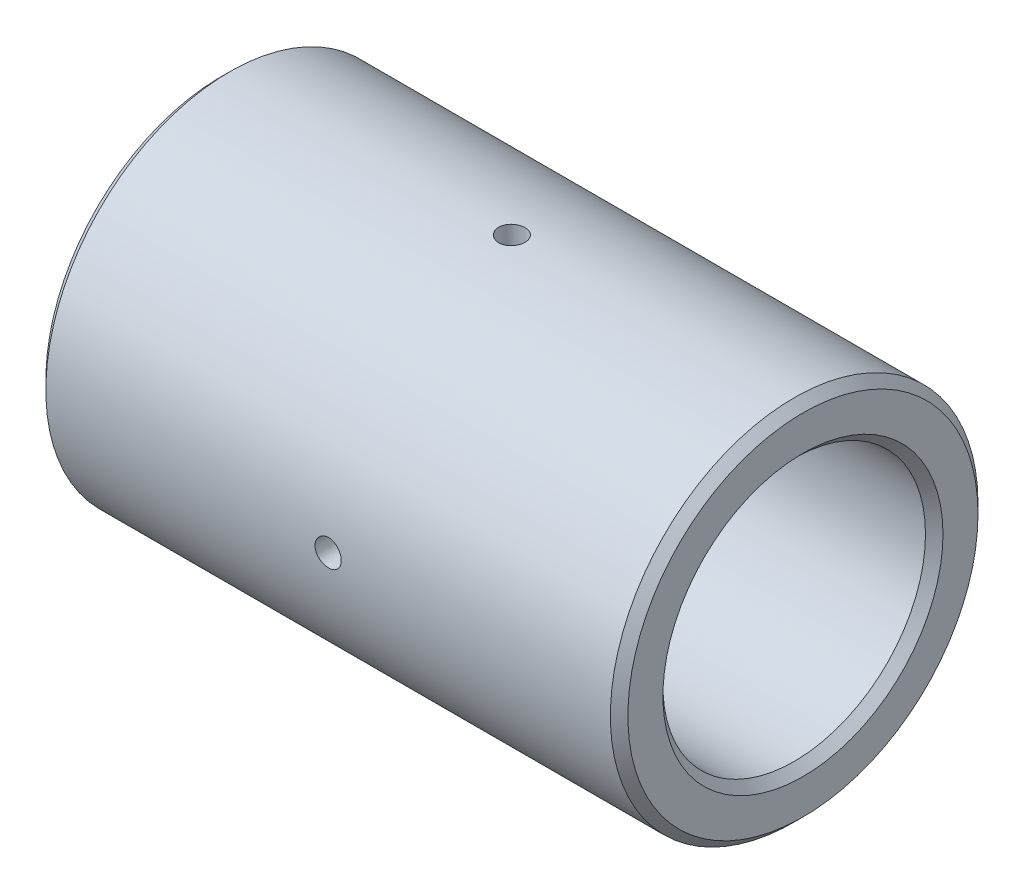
ISO-10303-21;
HEADER;
FILE_DESCRIPTION(('STEP AP214'),'2;1');
FILE_NAME('part.step','',(''),(''),'','','');
FILE_SCHEMA(('AUTOMOTIVE_DESIGN { 1 0 10303 214 1 1 1 1 }'));
ENDSEC;
DATA;
#1=APPLICATION_CONTEXT('core data for automotive mechanical design processes');
#2=APPLICATION_PROTOCOL_DEFINITION('international standard','automotive_design',2000,#1);
#3=PRODUCT_CONTEXT('',#1,'mechanical');
#4=PRODUCT('Part','Part','',(#3));
#5=PRODUCT_RELATED_PRODUCT_CATEGORY('part','',(#4));
#6=PRODUCT_DEFINITION_FORMATION('','',#4);
#7=PRODUCT_DEFINITION_CONTEXT('part definition',#1,'design');
#8=PRODUCT_DEFINITION('design','',#6,#7);
#9=PRODUCT_DEFINITION_SHAPE('','',#8);
#10=(LENGTH_UNIT() NAMED_UNIT(*) SI_UNIT(.MILLI.,.METRE.));
#11=(NAMED_UNIT(*) PLANE_ANGLE_UNIT() SI_UNIT($,.RADIAN.));
#12=(NAMED_UNIT(*) SI_UNIT($,.STERADIAN.) SOLID_ANGLE_UNIT());
#13=UNCERTAINTY_MEASURE_WITH_UNIT(LENGTH_MEASURE(1.E-05),#10,'distance_accuracy_value','');
#14=(GEOMETRIC_REPRESENTATION_CONTEXT(3) GLOBAL_UNCERTAINTY_ASSIGNED_CONTEXT((#13)) GLOBAL_UNIT_ASSIGNED_CONTEXT((#10,
#11,#12)) REPRESENTATION_CONTEXT('',''));
#15=CARTESIAN_POINT('',(0.,0.,0.));
#16=DIRECTION('',(0.,0.,1.));
#17=DIRECTION('',(1.,0.,0.));
#18=AXIS2_PLACEMENT_3D('',#15,#16,#17);
#19=CARTESIAN_POINT('',(94.5,0.,0.));
#20=DIRECTION('',(1.,0.,0.));
#21=DIRECTION('',(0.,0.,-1.));
#22=AXIS2_PLACEMENT_3D('',#19,#20,#21);
#23=CYLINDRICAL_SURFACE('',#22,17.);
#24=CARTESIAN_POINT('',(31.75,-1.77330760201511E-13,-17.));
#25=CARTESIAN_POINT('',(31.7500036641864,-0.0840802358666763,-16.9999991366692));
#26=CARTESIAN_POINT('',(31.7570932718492,-0.168217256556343,-16.9993695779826));
#27=CARTESIAN_POINT('',(31.7852700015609,-0.334162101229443,-16.9969186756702));
#28=CARTESIAN_POINT('',(31.8063728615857,-0.415967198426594,-16.9950959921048));
#29=CARTESIAN_POINT('',(31.8619599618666,-0.574820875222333,-16.9904647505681));
#30=CARTESIAN_POINT('',(31.8964364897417,-0.651872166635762,-16.987656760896));
#31=CARTESIAN_POINT('',(31.9777781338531,-0.799076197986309,-16.9813695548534));
#32=CARTESIAN_POINT('',(32.0246406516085,-0.869230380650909,-16.9778904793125));
#33=CARTESIAN_POINT('',(32.1295673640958,-1.00086587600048,-16.9706402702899));
#34=CARTESIAN_POINT('',(32.187659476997,-1.06232489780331,-16.9668684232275));
#35=CARTESIAN_POINT('',(32.3133371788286,-1.17463411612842,-16.9594637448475));
#36=CARTESIAN_POINT('',(32.3809231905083,-1.22548383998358,-16.9558309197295));
#37=CARTESIAN_POINT('',(32.523806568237,-1.31520757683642,-16.9491080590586));
#38=CARTESIAN_POINT('',(32.5991163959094,-1.35406181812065,-16.946018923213));
#39=CARTESIAN_POINT('',(32.7552229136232,-1.41856538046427,-16.9407415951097));
#40=CARTESIAN_POINT('',(32.8360194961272,-1.44421496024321,-16.9385533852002));
#41=CARTESIAN_POINT('',(33.0005813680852,-1.48151599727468,-16.9353318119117));
#42=CARTESIAN_POINT('',(33.0843383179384,-1.49320398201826,-16.9342954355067));
#43=CARTESIAN_POINT('',(33.2526310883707,-1.5023629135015,-16.9334854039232));
#44=CARTESIAN_POINT('',(33.3371668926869,-1.49983415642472,-16.9337117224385));
#45=CARTESIAN_POINT('',(33.5043669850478,-1.48066155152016,-16.9353987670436));
#46=CARTESIAN_POINT('',(33.5870358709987,-1.4640574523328,-16.9368560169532));
#47=CARTESIAN_POINT('',(33.7484088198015,-1.41726727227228,-16.9408352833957));
#48=CARTESIAN_POINT('',(33.827112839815,-1.38708104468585,-16.9433573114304));
#49=CARTESIAN_POINT('',(33.9784483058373,-1.31393915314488,-16.949185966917));
#50=CARTESIAN_POINT('',(34.0510711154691,-1.27096571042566,-16.9524936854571));
#51=CARTESIAN_POINT('',(34.1880882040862,-1.17348205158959,-16.9595200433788));
#52=CARTESIAN_POINT('',(34.2524822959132,-1.11897157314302,-16.9632386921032));
#53=CARTESIAN_POINT('',(34.3714451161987,-0.999738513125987,-16.9706833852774));
#54=CARTESIAN_POINT('',(34.4259794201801,-0.934981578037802,-16.9744094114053));
#55=CARTESIAN_POINT('',(34.5234082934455,-0.79721351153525,-16.9814369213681));
#56=CARTESIAN_POINT('',(34.5663028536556,-0.724202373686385,-16.984738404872));
#57=CARTESIAN_POINT('',(34.6392326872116,-0.571975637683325,-16.9905455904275));
#58=CARTESIAN_POINT('',(34.6692663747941,-0.492759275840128,-16.9930511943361));
#59=CARTESIAN_POINT('',(34.7155975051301,-0.330381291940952,-16.996983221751));
#60=CARTESIAN_POINT('',(34.7318952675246,-0.247219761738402,-16.9984096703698));
#61=CARTESIAN_POINT('',(34.750248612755,-0.0796104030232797,-17.0000194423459));
#62=CARTESIAN_POINT('',(34.7523517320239,0.00483218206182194,-17.0002069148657));
#63=CARTESIAN_POINT('',(34.7423807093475,0.172868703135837,-16.9993287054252));
#64=CARTESIAN_POINT('',(34.7303067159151,0.256462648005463,-16.9982630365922));
#65=CARTESIAN_POINT('',(34.6923636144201,0.42029296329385,-16.9950010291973));
#66=CARTESIAN_POINT('',(34.6665166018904,0.50053449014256,-16.9928065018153));
#67=CARTESIAN_POINT('',(34.6017837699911,0.655542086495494,-16.9875332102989));
#68=CARTESIAN_POINT('',(34.562897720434,0.730308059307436,-16.9844544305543));
#69=CARTESIAN_POINT('',(34.4730716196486,0.872458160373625,-16.9777472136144));
#70=CARTESIAN_POINT('',(34.422100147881,0.939822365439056,-16.9741173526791));
#71=CARTESIAN_POINT('',(34.309595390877,1.06505544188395,-16.9667203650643));
#72=CARTESIAN_POINT('',(34.2480618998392,1.12292412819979,-16.9629532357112));
#73=CARTESIAN_POINT('',(34.1159732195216,1.22768709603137,-16.9556939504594));
#74=CARTESIAN_POINT('',(34.0453933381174,1.27455030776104,-16.9522025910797));
#75=CARTESIAN_POINT('',(33.89733797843,1.35575886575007,-16.9459016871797));
#76=CARTESIAN_POINT('',(33.8198625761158,1.39010434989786,-16.9430921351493));
#77=CARTESIAN_POINT('',(33.6603244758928,1.44524983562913,-16.9384775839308));
#78=CARTESIAN_POINT('',(33.5782683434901,1.46606870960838,-16.9366711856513));
#79=CARTESIAN_POINT('',(33.4118084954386,1.49363139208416,-16.9342628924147));
#80=CARTESIAN_POINT('',(33.3274048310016,1.50037550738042,-16.9336609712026));
#81=CARTESIAN_POINT('',(33.1589546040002,1.49959349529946,-16.9337302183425));
#82=CARTESIAN_POINT('',(33.0749078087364,1.49211618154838,-16.934397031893));
#83=CARTESIAN_POINT('',(32.909268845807,1.46320550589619,-16.936919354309));
#84=CARTESIAN_POINT('',(32.8276766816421,1.44177212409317,-16.9387748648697));
#85=CARTESIAN_POINT('',(32.6692609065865,1.38557040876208,-16.9434643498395));
#86=CARTESIAN_POINT('',(32.5924369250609,1.35080311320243,-16.9462982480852));
#87=CARTESIAN_POINT('',(32.4457079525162,1.26892580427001,-16.9526253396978));
#88=CARTESIAN_POINT('',(32.3758028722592,1.22181595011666,-16.9561185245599));
#89=CARTESIAN_POINT('',(32.2446460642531,1.11640728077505,-16.9633848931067));
#90=CARTESIAN_POINT('',(32.1834235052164,1.05807223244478,-16.9671589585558));
#91=CARTESIAN_POINT('',(32.0716124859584,0.931936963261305,-16.9745537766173));
#92=CARTESIAN_POINT('',(32.0210265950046,0.864134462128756,-16.97817449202));
#93=CARTESIAN_POINT('',(31.9318483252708,0.720843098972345,-16.9848619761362));
#94=CARTESIAN_POINT('',(31.8932806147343,0.645338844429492,-16.9879276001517));
#95=CARTESIAN_POINT('',(31.8294204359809,0.488949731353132,-16.9931463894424));
#96=CARTESIAN_POINT('',(31.8041127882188,0.408071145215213,-16.9953005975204));
#97=CARTESIAN_POINT('',(31.7738994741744,0.272267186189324,-16.9979040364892));
#98=CARTESIAN_POINT('',(31.764949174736,0.218213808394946,-16.9986864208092));
#99=CARTESIAN_POINT('',(31.7529982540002,0.10944830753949,-16.9997346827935));
#100=CARTESIAN_POINT('',(31.7499976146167,0.0547361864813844,-17.0000005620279));
#101=CARTESIAN_POINT('',(31.75,-1.77330760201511E-13,-17.));
#102=B_SPLINE_CURVE_WITH_KNOTS('',3,(#24,#25,#26,#27,#28,#29,#30,#31,#32,#33,#34,#35,#36,#37,
#38,#39,#40,#41,#42,#43,#44,#45,#46,#47,#48,#49,#50,#51,#52,#53,#54,#55,#56,#57,#58,#59,#60,#61,
#62,#63,#64,#65,#66,#67,#68,#69,#70,#71,#72,#73,#74,#75,#76,#77,#78,#79,#80,#81,#82,#83,#84,#85,
#86,#87,#88,#89,#90,#91,#92,#93,#94,#95,#96,#97,#98,#99,#100,#101),.UNSPECIFIED.,.T.,.F.,(4,2,2,
2,2,2,2,2,2,2,2,2,2,2,2,2,2,2,2,2,2,2,2,2,2,2,2,2,2,2,2,2,2,2,2,2,2,2,4),(0.,0.252040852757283,
0.504365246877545,0.756544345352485,1.00867058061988,1.26143188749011,1.51420445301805,
1.76739145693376,2.020573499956,2.27309168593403,2.52560461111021,2.77740680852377,
3.02921172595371,3.28136839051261,3.5335307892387,3.7865572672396,4.03958394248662,
4.29264180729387,4.54569378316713,4.79789789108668,5.05009935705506,5.30189743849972,
5.55369996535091,5.80616446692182,6.0586338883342,6.31180771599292,6.56497875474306,
6.81779580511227,7.0706073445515,7.32255269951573,7.57449841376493,7.82642451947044,
8.07834737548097,8.331097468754,8.58390854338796,8.8372351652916,9.09027115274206,
9.25435010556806,9.41842855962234),.UNSPECIFIED.);
#103=CARTESIAN_POINT('',(31.75,-1.77330760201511E-13,-17.));
#104=VERTEX_POINT('',#103);
#105=CARTESIAN_POINT('',(34.75,-1.77330760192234E-13,-17.));
#106=VERTEX_POINT('',#105);
#107=EDGE_CURVE('E11',#104,#106,#102,.T.);
#108=ORIENTED_EDGE('',*,*,#107,.F.);
#109=CARTESIAN_POINT('',(31.75,0.,0.));
#110=DIRECTION('',(1.,0.,0.));
#111=DIRECTION('',(0.,0.,-1.));
#112=AXIS2_PLACEMENT_3D('',#109,#110,#111);
#113=CIRCLE('',#112,17.);
#114=CARTESIAN_POINT('',(31.75,-17.,0.));
#115=VERTEX_POINT('',#114);
#116=EDGE_CURVE('E119',#115,#104,#113,.T.);
#117=ORIENTED_EDGE('',*,*,#116,.F.);
#118=CARTESIAN_POINT('',(31.75,-17.,0.));
#119=CARTESIAN_POINT('',(31.7500036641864,-16.9999991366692,0.0840802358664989));
#120=CARTESIAN_POINT('',(31.7570932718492,-16.9993695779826,0.168217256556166));
#121=CARTESIAN_POINT('',(31.7852700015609,-16.9969186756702,0.334162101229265));
#122=CARTESIAN_POINT('',(31.8063728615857,-16.9950959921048,0.415967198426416));
#123=CARTESIAN_POINT('',(31.8619599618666,-16.9904647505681,0.574820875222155));
#124=CARTESIAN_POINT('',(31.8964364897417,-16.987656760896,0.651872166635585));
#125=CARTESIAN_POINT('',(31.9777781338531,-16.9813695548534,0.799076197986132));
#126=CARTESIAN_POINT('',(32.0246406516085,-16.9778904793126,0.869230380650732));
#127=CARTESIAN_POINT('',(32.1295673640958,-16.9706402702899,1.0008658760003));
#128=CARTESIAN_POINT('',(32.187659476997,-16.9668684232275,1.06232489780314));
#129=CARTESIAN_POINT('',(32.3133371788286,-16.9594637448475,1.17463411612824));
#130=CARTESIAN_POINT('',(32.3809231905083,-16.9558309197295,1.22548383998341));
#131=CARTESIAN_POINT('',(32.523806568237,-16.9491080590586,1.31520757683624));
#132=CARTESIAN_POINT('',(32.5991163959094,-16.9460189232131,1.35406181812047));
#133=CARTESIAN_POINT('',(32.7552229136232,-16.9407415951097,1.41856538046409));
#134=CARTESIAN_POINT('',(32.8360194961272,-16.9385533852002,1.44421496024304));
#135=CARTESIAN_POINT('',(33.0005813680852,-16.9353318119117,1.4815159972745));
#136=CARTESIAN_POINT('',(33.0843383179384,-16.9342954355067,1.49320398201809));
#137=CARTESIAN_POINT('',(33.2526310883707,-16.9334854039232,1.50236291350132));
#138=CARTESIAN_POINT('',(33.3371668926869,-16.9337117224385,1.49983415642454));
#139=CARTESIAN_POINT('',(33.5043669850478,-16.9353987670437,1.48066155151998));
#140=CARTESIAN_POINT('',(33.5870358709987,-16.9368560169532,1.46405745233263));
#141=CARTESIAN_POINT('',(33.7484088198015,-16.9408352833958,1.41726727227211));
#142=CARTESIAN_POINT('',(33.827112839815,-16.9433573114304,1.38708104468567));
#143=CARTESIAN_POINT('',(33.9784483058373,-16.949185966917,1.3139391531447));
#144=CARTESIAN_POINT('',(34.0510711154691,-16.9524936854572,1.27096571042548));
#145=CARTESIAN_POINT('',(34.1880882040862,-16.9595200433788,1.17348205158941));
#146=CARTESIAN_POINT('',(34.2524822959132,-16.9632386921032,1.11897157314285));
#147=CARTESIAN_POINT('',(34.3714451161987,-16.9706833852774,0.99973851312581));
#148=CARTESIAN_POINT('',(34.4259794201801,-16.9744094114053,0.934981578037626));
#149=CARTESIAN_POINT('',(34.5234082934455,-16.9814369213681,0.797213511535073));
#150=CARTESIAN_POINT('',(34.5663028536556,-16.984738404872,0.724202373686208));
#151=CARTESIAN_POINT('',(34.6392326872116,-16.9905455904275,0.571975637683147));
#152=CARTESIAN_POINT('',(34.6692663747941,-16.9930511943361,0.492759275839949));
#153=CARTESIAN_POINT('',(34.7155975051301,-16.996983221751,0.330381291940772));
#154=CARTESIAN_POINT('',(34.7318952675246,-16.9984096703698,0.247219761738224));
#155=CARTESIAN_POINT('',(34.750248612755,-17.0000194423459,0.0796104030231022));
#156=CARTESIAN_POINT('',(34.7523517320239,-17.0002069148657,-0.00483218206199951));
#157=CARTESIAN_POINT('',(34.7423807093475,-16.9993287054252,-0.172868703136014));
#158=CARTESIAN_POINT('',(34.7303067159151,-16.9982630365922,-0.25646264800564));
#159=CARTESIAN_POINT('',(34.6923636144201,-16.9950010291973,-0.420292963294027));
#160=CARTESIAN_POINT('',(34.6665166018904,-16.9928065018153,-0.500534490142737));
#161=CARTESIAN_POINT('',(34.6017837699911,-16.9875332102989,-0.655542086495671));
#162=CARTESIAN_POINT('',(34.562897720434,-16.9844544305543,-0.730308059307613));
#163=CARTESIAN_POINT('',(34.4730716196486,-16.9777472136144,-0.872458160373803));
#164=CARTESIAN_POINT('',(34.422100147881,-16.9741173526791,-0.939822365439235));
#165=CARTESIAN_POINT('',(34.309595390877,-16.9667203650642,-1.06505544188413));
#166=CARTESIAN_POINT('',(34.2480618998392,-16.9629532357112,-1.12292412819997));
#167=CARTESIAN_POINT('',(34.1159732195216,-16.9556939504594,-1.22768709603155));
#168=CARTESIAN_POINT('',(34.0453933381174,-16.9522025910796,-1.27455030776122));
#169=CARTESIAN_POINT('',(33.89733797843,-16.9459016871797,-1.35575886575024));
#170=CARTESIAN_POINT('',(33.8198625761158,-16.9430921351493,-1.39010434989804));
#171=CARTESIAN_POINT('',(33.6603244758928,-16.9384775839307,-1.44524983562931));
#172=CARTESIAN_POINT('',(33.5782683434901,-16.9366711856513,-1.46606870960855));
#173=CARTESIAN_POINT('',(33.4118084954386,-16.9342628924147,-1.49363139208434));
#174=CARTESIAN_POINT('',(33.3274048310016,-16.9336609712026,-1.50037550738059));
#175=CARTESIAN_POINT('',(33.1589546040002,-16.9337302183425,-1.49959349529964));
#176=CARTESIAN_POINT('',(33.0749078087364,-16.934397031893,-1.49211618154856));
#177=CARTESIAN_POINT('',(32.909268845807,-16.936919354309,-1.46320550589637));
#178=CARTESIAN_POINT('',(32.8276766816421,-16.9387748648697,-1.44177212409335));
#179=CARTESIAN_POINT('',(32.6692609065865,-16.9434643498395,-1.38557040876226));
#180=CARTESIAN_POINT('',(32.5924369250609,-16.9462982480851,-1.35080311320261));
#181=CARTESIAN_POINT('',(32.4457079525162,-16.9526253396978,-1.26892580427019));
#182=CARTESIAN_POINT('',(32.3758028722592,-16.9561185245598,-1.22181595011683));
#183=CARTESIAN_POINT('',(32.2446460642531,-16.9633848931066,-1.11640728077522));
#184=CARTESIAN_POINT('',(32.1834235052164,-16.9671589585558,-1.05807223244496));
#185=CARTESIAN_POINT('',(32.0716124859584,-16.9745537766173,-0.93193696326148));
#186=CARTESIAN_POINT('',(32.0210265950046,-16.97817449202,-0.864134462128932));
#187=CARTESIAN_POINT('',(31.9318483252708,-16.9848619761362,-0.720843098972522));
#188=CARTESIAN_POINT('',(31.8932806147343,-16.9879276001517,-0.645338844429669));
#189=CARTESIAN_POINT('',(31.8294204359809,-16.9931463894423,-0.488949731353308));
#190=CARTESIAN_POINT('',(31.8041127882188,-16.9953005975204,-0.40807114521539));
#191=CARTESIAN_POINT('',(31.7738994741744,-16.9979040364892,-0.272267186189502));
#192=CARTESIAN_POINT('',(31.764949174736,-16.9986864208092,-0.218213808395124));
#193=CARTESIAN_POINT('',(31.7529982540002,-16.9997346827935,-0.109448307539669));
#194=CARTESIAN_POINT('',(31.7499976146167,-17.0000005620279,-0.0547361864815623));
#195=CARTESIAN_POINT('',(31.75,-17.,0.));
#196=B_SPLINE_CURVE_WITH_KNOTS('',3,(#118,#119,#120,#121,#122,#123,#124,#125,#126,#127,#128,
#129,#130,#131,#132,#133,#134,#135,#136,#137,#138,#139,#140,#141,#142,#143,#144,#145,#146,#147,
#148,#149,#150,#151,#152,#153,#154,#155,#156,#157,#158,#159,#160,#161,#162,#163,#164,#165,#166,
#167,#168,#169,#170,#171,#172,#173,#174,#175,#176,#177,#178,#179,#180,#181,#182,#183,#184,#185,
#186,#187,#188,#189,#190,#191,#192,#193,#194,#195),.UNSPECIFIED.,.T.,.F.,(4,2,2,2,2,2,2,2,2,2,2,
2,2,2,2,2,2,2,2,2,2,2,2,2,2,2,2,2,2,2,2,2,2,2,2,2,2,2,4),(0.,0.252040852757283,
0.504365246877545,0.756544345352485,1.00867058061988,1.26143188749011,1.51420445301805,
1.76739145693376,2.020573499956,2.27309168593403,2.52560461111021,2.77740680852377,
3.02921172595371,3.28136839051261,3.5335307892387,3.7865572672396,4.03958394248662,
4.29264180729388,4.54569378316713,4.79789789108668,5.05009935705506,5.30189743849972,
5.5536999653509,5.80616446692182,6.05863388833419,6.31180771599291,6.56497875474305,
6.81779580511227,7.0706073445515,7.32255269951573,7.57449841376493,7.82642451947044,
8.07834737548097,8.33109746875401,8.58390854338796,8.8372351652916,9.09027115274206,
9.25435010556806,9.41842855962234),.UNSPECIFIED.);
#197=CARTESIAN_POINT('',(34.75,-17.,0.));
#198=VERTEX_POINT('',#197);
#199=EDGE_CURVE('E109',#198,#115,#196,.T.);
#200=ORIENTED_EDGE('',*,*,#199,.F.);
#201=CARTESIAN_POINT('',(34.75,0.,0.));
#202=DIRECTION('',(1.,0.,0.));
#203=DIRECTION('',(0.,0.,-1.));
#204=AXIS2_PLACEMENT_3D('',#201,#202,#203);
#205=CIRCLE('',#204,17.);
#206=EDGE_CURVE('E103',#198,#106,#205,.T.);
#207=ORIENTED_EDGE('',*,*,#206,.T.);
#208=EDGE_LOOP('',(#108,#117,#200,#207));
#209=FACE_BOUND('',#208,.T.);
#210=ADVANCED_FACE('F43',(#209),#23,.F.);
#211=EDGE_CURVE('E47',#106,#104,#102,.T.);
#212=ORIENTED_EDGE('',*,*,#211,.F.);
#213=CARTESIAN_POINT('',(34.75,17.,0.));
#214=VERTEX_POINT('',#213);
#215=EDGE_CURVE('E93',#106,#214,#205,.T.);
#216=ORIENTED_EDGE('',*,*,#215,.T.);
#217=CARTESIAN_POINT('',(31.75,17.,0.));
#218=CARTESIAN_POINT('',(31.7500036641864,16.9999991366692,-0.0840802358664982));
#219=CARTESIAN_POINT('',(31.7570932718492,16.9993695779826,-0.168217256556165));
#220=CARTESIAN_POINT('',(31.7852700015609,16.9969186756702,-0.334162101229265));
#221=CARTESIAN_POINT('',(31.8063728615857,16.9950959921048,-0.415967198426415));
#222=CARTESIAN_POINT('',(31.8619599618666,16.9904647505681,-0.574820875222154));
#223=CARTESIAN_POINT('',(31.8964364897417,16.987656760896,-0.651872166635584));
#224=CARTESIAN_POINT('',(31.9777781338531,16.9813695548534,-0.799076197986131));
#225=CARTESIAN_POINT('',(32.0246406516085,16.9778904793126,-0.869230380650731));
#226=CARTESIAN_POINT('',(32.1295673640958,16.9706402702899,-1.0008658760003));
#227=CARTESIAN_POINT('',(32.187659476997,16.9668684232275,-1.06232489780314));
#228=CARTESIAN_POINT('',(32.3133371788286,16.9594637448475,-1.17463411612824));
#229=CARTESIAN_POINT('',(32.3809231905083,16.9558309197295,-1.22548383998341));
#230=CARTESIAN_POINT('',(32.523806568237,16.9491080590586,-1.31520757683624));
#231=CARTESIAN_POINT('',(32.5991163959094,16.9460189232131,-1.35406181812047));
#232=CARTESIAN_POINT('',(32.7552229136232,16.9407415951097,-1.41856538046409));
#233=CARTESIAN_POINT('',(32.8360194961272,16.9385533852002,-1.44421496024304));
#234=CARTESIAN_POINT('',(33.0005813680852,16.9353318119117,-1.4815159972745));
#235=CARTESIAN_POINT('',(33.0843383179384,16.9342954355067,-1.49320398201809));
#236=CARTESIAN_POINT('',(33.2526310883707,16.9334854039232,-1.50236291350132));
#237=CARTESIAN_POINT('',(33.3371668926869,16.9337117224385,-1.49983415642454));
#238=CARTESIAN_POINT('',(33.5043669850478,16.9353987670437,-1.48066155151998));
#239=CARTESIAN_POINT('',(33.5870358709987,16.9368560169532,-1.46405745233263));
#240=CARTESIAN_POINT('',(33.7484088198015,16.9408352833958,-1.41726727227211));
#241=CARTESIAN_POINT('',(33.827112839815,16.9433573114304,-1.38708104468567));
#242=CARTESIAN_POINT('',(33.9784483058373,16.949185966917,-1.3139391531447));
#243=CARTESIAN_POINT('',(34.0510711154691,16.9524936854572,-1.27096571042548));
#244=CARTESIAN_POINT('',(34.1880882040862,16.9595200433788,-1.17348205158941));
#245=CARTESIAN_POINT('',(34.2524822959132,16.9632386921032,-1.11897157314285));
#246=CARTESIAN_POINT('',(34.3714451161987,16.9706833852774,-0.999738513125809));
#247=CARTESIAN_POINT('',(34.4259794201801,16.9744094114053,-0.934981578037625));
#248=CARTESIAN_POINT('',(34.5234082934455,16.9814369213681,-0.797213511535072));
#249=CARTESIAN_POINT('',(34.5663028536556,16.984738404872,-0.724202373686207));
#250=CARTESIAN_POINT('',(34.6392326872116,16.9905455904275,-0.571975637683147));
#251=CARTESIAN_POINT('',(34.6692663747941,16.9930511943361,-0.49275927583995));
#252=CARTESIAN_POINT('',(34.7155975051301,16.996983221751,-0.330381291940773));
#253=CARTESIAN_POINT('',(34.7318952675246,16.9984096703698,-0.247219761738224));
#254=CARTESIAN_POINT('',(34.750248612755,17.0000194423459,-0.0796104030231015));
#255=CARTESIAN_POINT('',(34.7523517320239,17.0002069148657,0.0048321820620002));
#256=CARTESIAN_POINT('',(34.7423807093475,16.9993287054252,0.172868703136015));
#257=CARTESIAN_POINT('',(34.7303067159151,16.9982630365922,0.256462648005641));
#258=CARTESIAN_POINT('',(34.6923636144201,16.9950010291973,0.420292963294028));
#259=CARTESIAN_POINT('',(34.6665166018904,16.9928065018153,0.500534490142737));
#260=CARTESIAN_POINT('',(34.6017837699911,16.9875332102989,0.655542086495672));
#261=CARTESIAN_POINT('',(34.562897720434,16.9844544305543,0.730308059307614));
#262=CARTESIAN_POINT('',(34.4730716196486,16.9777472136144,0.872458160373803));
#263=CARTESIAN_POINT('',(34.422100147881,16.9741173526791,0.939822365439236));
#264=CARTESIAN_POINT('',(34.309595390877,16.9667203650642,1.06505544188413));
#265=CARTESIAN_POINT('',(34.2480618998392,16.9629532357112,1.12292412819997));
#266=CARTESIAN_POINT('',(34.1159732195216,16.9556939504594,1.22768709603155));
#267=CARTESIAN_POINT('',(34.0453933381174,16.9522025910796,1.27455030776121));
#268=CARTESIAN_POINT('',(33.89733797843,16.9459016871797,1.35575886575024));
#269=CARTESIAN_POINT('',(33.8198625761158,16.9430921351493,1.39010434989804));
#270=CARTESIAN_POINT('',(33.6603244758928,16.9384775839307,1.44524983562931));
#271=CARTESIAN_POINT('',(33.5782683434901,16.9366711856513,1.46606870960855));
#272=CARTESIAN_POINT('',(33.4118084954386,16.9342628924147,1.49363139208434));
#273=CARTESIAN_POINT('',(33.3274048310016,16.9336609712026,1.50037550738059));
#274=CARTESIAN_POINT('',(33.1589546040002,16.9337302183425,1.49959349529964));
#275=CARTESIAN_POINT('',(33.0749078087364,16.934397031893,1.49211618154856));
#276=CARTESIAN_POINT('',(32.909268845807,16.936919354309,1.46320550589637));
#277=CARTESIAN_POINT('',(32.8276766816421,16.9387748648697,1.44177212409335));
#278=CARTESIAN_POINT('',(32.6692609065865,16.9434643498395,1.38557040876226));
#279=CARTESIAN_POINT('',(32.5924369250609,16.9462982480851,1.3508031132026));
#280=CARTESIAN_POINT('',(32.4457079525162,16.9526253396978,1.26892580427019));
#281=CARTESIAN_POINT('',(32.3758028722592,16.9561185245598,1.22181595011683));
#282=CARTESIAN_POINT('',(32.2446460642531,16.9633848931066,1.11640728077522));
#283=CARTESIAN_POINT('',(32.1834235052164,16.9671589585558,1.05807223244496));
#284=CARTESIAN_POINT('',(32.0716124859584,16.9745537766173,0.931936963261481));
#285=CARTESIAN_POINT('',(32.0210265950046,16.97817449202,0.864134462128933));
#286=CARTESIAN_POINT('',(31.9318483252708,16.9848619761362,0.720843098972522));
#287=CARTESIAN_POINT('',(31.8932806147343,16.9879276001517,0.645338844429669));
#288=CARTESIAN_POINT('',(31.8294204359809,16.9931463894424,0.488949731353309));
#289=CARTESIAN_POINT('',(31.8041127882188,16.9953005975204,0.408071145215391));
#290=CARTESIAN_POINT('',(31.7738994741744,16.9979040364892,0.272267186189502));
#291=CARTESIAN_POINT('',(31.764949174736,16.9986864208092,0.218213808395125));
#292=CARTESIAN_POINT('',(31.7529982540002,16.9997346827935,0.10944830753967));
#293=CARTESIAN_POINT('',(31.7499976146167,17.0000005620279,0.054736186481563));
#294=CARTESIAN_POINT('',(31.75,17.,0.));
#295=B_SPLINE_CURVE_WITH_KNOTS('',3,(#217,#218,#219,#220,#221,#222,#223,#224,#225,#226,#227,
#228,#229,#230,#231,#232,#233,#234,#235,#236,#237,#238,#239,#240,#241,#242,#243,#244,#245,#246,
#247,#248,#249,#250,#251,#252,#253,#254,#255,#256,#257,#258,#259,#260,#261,#262,#263,#264,#265,
#266,#267,#268,#269,#270,#271,#272,#273,#274,#275,#276,#277,#278,#279,#280,#281,#282,#283,#284,
#285,#286,#287,#288,#289,#290,#291,#292,#293,#294),.UNSPECIFIED.,.T.,.F.,(4,2,2,2,2,2,2,2,2,2,2,
2,2,2,2,2,2,2,2,2,2,2,2,2,2,2,2,2,2,2,2,2,2,2,2,2,2,2,4),(0.,0.252040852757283,
0.504365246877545,0.756544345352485,1.00867058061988,1.26143188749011,1.51420445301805,
1.76739145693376,2.020573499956,2.27309168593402,2.52560461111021,2.77740680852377,
3.02921172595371,3.28136839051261,3.5335307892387,3.7865572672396,4.03958394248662,
4.29264180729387,4.54569378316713,4.79789789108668,5.05009935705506,5.30189743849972,
5.5536999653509,5.80616446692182,6.05863388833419,6.3118077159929,6.56497875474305,
6.81779580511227,7.0706073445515,7.32255269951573,7.57449841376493,7.82642451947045,
8.07834737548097,8.33109746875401,8.58390854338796,8.8372351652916,9.09027115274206,
9.25435010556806,9.41842855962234),.UNSPECIFIED.);
#296=CARTESIAN_POINT('',(31.75,17.,0.));
#297=VERTEX_POINT('',#296);
#298=EDGE_CURVE('E96',#297,#214,#295,.T.);
#299=ORIENTED_EDGE('',*,*,#298,.F.);
#300=EDGE_CURVE('E68',#104,#297,#113,.T.);
#301=ORIENTED_EDGE('',*,*,#300,.F.);
#302=EDGE_LOOP('',(#212,#216,#299,#301));
#303=FACE_BOUND('',#302,.T.);
#304=ADVANCED_FACE('F91',(#303),#23,.F.);
#305=EDGE_CURVE('E233',#214,#297,#295,.T.);
#306=ORIENTED_EDGE('',*,*,#305,.F.);
#307=CARTESIAN_POINT('',(34.75,0.,17.));
#308=VERTEX_POINT('',#307);
#309=EDGE_CURVE('E104',#214,#308,#205,.T.);
#310=ORIENTED_EDGE('',*,*,#309,.T.);
#311=CARTESIAN_POINT('',(31.75,0.,17.));
#312=CARTESIAN_POINT('',(31.7500036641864,0.0840802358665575,16.9999991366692));
#313=CARTESIAN_POINT('',(31.7570932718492,0.168217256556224,16.9993695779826));
#314=CARTESIAN_POINT('',(31.7852700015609,0.334162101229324,16.9969186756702));
#315=CARTESIAN_POINT('',(31.8063728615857,0.415967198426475,16.9950959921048));
#316=CARTESIAN_POINT('',(31.8619599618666,0.574820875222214,16.9904647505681));
#317=CARTESIAN_POINT('',(31.8964364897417,0.651872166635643,16.987656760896));
#318=CARTESIAN_POINT('',(31.9777781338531,0.79907619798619,16.9813695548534));
#319=CARTESIAN_POINT('',(32.0246406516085,0.86923038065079,16.9778904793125));
#320=CARTESIAN_POINT('',(32.1295673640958,1.00086587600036,16.9706402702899));
#321=CARTESIAN_POINT('',(32.187659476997,1.0623248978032,16.9668684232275));
#322=CARTESIAN_POINT('',(32.3133371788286,1.1746341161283,16.9594637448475));
#323=CARTESIAN_POINT('',(32.3809231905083,1.22548383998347,16.9558309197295));
#324=CARTESIAN_POINT('',(32.523806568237,1.3152075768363,16.9491080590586));
#325=CARTESIAN_POINT('',(32.5991163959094,1.35406181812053,16.946018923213));
#326=CARTESIAN_POINT('',(32.7552229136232,1.41856538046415,16.9407415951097));
#327=CARTESIAN_POINT('',(32.8360194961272,1.44421496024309,16.9385533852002));
#328=CARTESIAN_POINT('',(33.0005813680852,1.48151599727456,16.9353318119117));
#329=CARTESIAN_POINT('',(33.0843383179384,1.49320398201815,16.9342954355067));
#330=CARTESIAN_POINT('',(33.2526310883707,1.50236291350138,16.9334854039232));
#331=CARTESIAN_POINT('',(33.3371668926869,1.4998341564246,16.9337117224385));
#332=CARTESIAN_POINT('',(33.5043669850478,1.48066155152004,16.9353987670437));
#333=CARTESIAN_POINT('',(33.5870358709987,1.46405745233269,16.9368560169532));
#334=CARTESIAN_POINT('',(33.7484088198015,1.41726727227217,16.9408352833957));
#335=CARTESIAN_POINT('',(33.827112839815,1.38708104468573,16.9433573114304));
#336=CARTESIAN_POINT('',(33.9784483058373,1.31393915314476,16.949185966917));
#337=CARTESIAN_POINT('',(34.0510711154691,1.27096571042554,16.9524936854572));
#338=CARTESIAN_POINT('',(34.1880882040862,1.17348205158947,16.9595200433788));
#339=CARTESIAN_POINT('',(34.2524822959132,1.11897157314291,16.9632386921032));
#340=CARTESIAN_POINT('',(34.3714451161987,0.999738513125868,16.9706833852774));
#341=CARTESIAN_POINT('',(34.4259794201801,0.934981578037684,16.9744094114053));
#342=CARTESIAN_POINT('',(34.5234082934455,0.797213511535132,16.9814369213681));
#343=CARTESIAN_POINT('',(34.5663028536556,0.724202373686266,16.984738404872));
#344=CARTESIAN_POINT('',(34.6392326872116,0.571975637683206,16.9905455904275));
#345=CARTESIAN_POINT('',(34.6692663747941,0.492759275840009,16.9930511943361));
#346=CARTESIAN_POINT('',(34.7155975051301,0.330381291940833,16.996983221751));
#347=CARTESIAN_POINT('',(34.7318952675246,0.247219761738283,16.9984096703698));
#348=CARTESIAN_POINT('',(34.750248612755,0.0796104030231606,17.0000194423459));
#349=CARTESIAN_POINT('',(34.7523517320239,-0.00483218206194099,17.0002069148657));
#350=CARTESIAN_POINT('',(34.7423807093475,-0.172868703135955,16.9993287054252));
#351=CARTESIAN_POINT('',(34.7303067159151,-0.256462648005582,16.9982630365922));
#352=CARTESIAN_POINT('',(34.6923636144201,-0.420292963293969,16.9950010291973));
#353=CARTESIAN_POINT('',(34.6665166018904,-0.500534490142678,16.9928065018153));
#354=CARTESIAN_POINT('',(34.6017837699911,-0.655542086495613,16.9875332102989));
#355=CARTESIAN_POINT('',(34.562897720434,-0.730308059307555,16.9844544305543));
#356=CARTESIAN_POINT('',(34.4730716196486,-0.872458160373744,16.9777472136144));
#357=CARTESIAN_POINT('',(34.422100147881,-0.939822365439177,16.9741173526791));
#358=CARTESIAN_POINT('',(34.309595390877,-1.06505544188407,16.9667203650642));
#359=CARTESIAN_POINT('',(34.2480618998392,-1.12292412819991,16.9629532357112));
#360=CARTESIAN_POINT('',(34.1159732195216,-1.22768709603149,16.9556939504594));
#361=CARTESIAN_POINT('',(34.0453933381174,-1.27455030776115,16.9522025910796));
#362=CARTESIAN_POINT('',(33.89733797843,-1.35575886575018,16.9459016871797));
#363=CARTESIAN_POINT('',(33.8198625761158,-1.39010434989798,16.9430921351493));
#364=CARTESIAN_POINT('',(33.6603244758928,-1.44524983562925,16.9384775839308));
#365=CARTESIAN_POINT('',(33.5782683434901,-1.46606870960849,16.9366711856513));
#366=CARTESIAN_POINT('',(33.4118084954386,-1.49363139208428,16.9342628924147));
#367=CARTESIAN_POINT('',(33.3274048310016,-1.50037550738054,16.9336609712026));
#368=CARTESIAN_POINT('',(33.1589546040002,-1.49959349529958,16.9337302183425));
#369=CARTESIAN_POINT('',(33.0749078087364,-1.4921161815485,16.934397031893));
#370=CARTESIAN_POINT('',(32.909268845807,-1.46320550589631,16.936919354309));
#371=CARTESIAN_POINT('',(32.8276766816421,-1.44177212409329,16.9387748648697));
#372=CARTESIAN_POINT('',(32.6692609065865,-1.3855704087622,16.9434643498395));
#373=CARTESIAN_POINT('',(32.5924369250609,-1.35080311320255,16.9462982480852));
#374=CARTESIAN_POINT('',(32.4457079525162,-1.26892580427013,16.9526253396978));
#375=CARTESIAN_POINT('',(32.3758028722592,-1.22181595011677,16.9561185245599));
#376=CARTESIAN_POINT('',(32.2446460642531,-1.11640728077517,16.9633848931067));
#377=CARTESIAN_POINT('',(32.1834235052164,-1.0580722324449,16.9671589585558));
#378=CARTESIAN_POINT('',(32.0716124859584,-0.931936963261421,16.9745537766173));
#379=CARTESIAN_POINT('',(32.0210265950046,-0.864134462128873,16.97817449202));
#380=CARTESIAN_POINT('',(31.9318483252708,-0.720843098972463,16.9848619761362));
#381=CARTESIAN_POINT('',(31.8932806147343,-0.64533884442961,16.9879276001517));
#382=CARTESIAN_POINT('',(31.8294204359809,-0.488949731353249,16.9931463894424));
#383=CARTESIAN_POINT('',(31.8041127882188,-0.408071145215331,16.9953005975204));
#384=CARTESIAN_POINT('',(31.7738994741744,-0.272267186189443,16.9979040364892));
#385=CARTESIAN_POINT('',(31.764949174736,-0.218213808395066,16.9986864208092));
#386=CARTESIAN_POINT('',(31.7529982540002,-0.10944830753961,16.9997346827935));
#387=CARTESIAN_POINT('',(31.7499976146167,-0.0547361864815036,17.0000005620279));
#388=CARTESIAN_POINT('',(31.75,0.,17.));
#389=B_SPLINE_CURVE_WITH_KNOTS('',3,(#311,#312,#313,#314,#315,#316,#317,#318,#319,#320,#321,
#322,#323,#324,#325,#326,#327,#328,#329,#330,#331,#332,#333,#334,#335,#336,#337,#338,#339,#340,
#341,#342,#343,#344,#345,#346,#347,#348,#349,#350,#351,#352,#353,#354,#355,#356,#357,#358,#359,
#360,#361,#362,#363,#364,#365,#366,#367,#368,#369,#370,#371,#372,#373,#374,#375,#376,#377,#378,
#379,#380,#381,#382,#383,#384,#385,#386,#387,#388),.UNSPECIFIED.,.T.,.F.,(4,2,2,2,2,2,2,2,2,2,2,
2,2,2,2,2,2,2,2,2,2,2,2,2,2,2,2,2,2,2,2,2,2,2,2,2,2,2,4),(0.,0.252040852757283,
0.504365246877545,0.756544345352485,1.00867058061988,1.26143188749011,1.51420445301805,
1.76739145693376,2.020573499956,2.27309168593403,2.52560461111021,2.77740680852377,
3.02921172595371,3.28136839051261,3.5335307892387,3.7865572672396,4.03958394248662,
4.29264180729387,4.54569378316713,4.79789789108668,5.05009935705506,5.30189743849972,
5.55369996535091,5.80616446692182,6.0586338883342,6.31180771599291,6.56497875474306,
6.81779580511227,7.0706073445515,7.32255269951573,7.57449841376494,7.82642451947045,
8.07834737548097,8.33109746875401,8.58390854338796,8.8372351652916,9.09027115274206,
9.25435010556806,9.41842855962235),.UNSPECIFIED.);
#390=CARTESIAN_POINT('',(31.75,0.,17.));
#391=VERTEX_POINT('',#390);
#392=EDGE_CURVE('E238',#391,#308,#389,.T.);
#393=ORIENTED_EDGE('',*,*,#392,.F.);
#394=EDGE_CURVE('E128',#297,#391,#113,.T.);
#395=ORIENTED_EDGE('',*,*,#394,.F.);
#396=EDGE_LOOP('',(#306,#310,#393,#395));
#397=FACE_BOUND('',#396,.T.);
#398=ADVANCED_FACE('F211',(#397),#23,.F.);
#399=CARTESIAN_POINT('',(65.5,0.,0.));
#400=DIRECTION('',(1.,0.,0.));
#401=DIRECTION('',(0.,0.,-1.));
#402=AXIS2_PLACEMENT_3D('',#399,#400,#401);
#403=CONICAL_SURFACE('',#402,15.,0.785398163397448);
#404=CARTESIAN_POINT('',(66.5,0.,0.));
#405=DIRECTION('',(1.,0.,0.));
#406=DIRECTION('',(0.,0.,-1.));
#407=AXIS2_PLACEMENT_3D('',#404,#405,#406);
#408=CIRCLE('',#407,16.);
#409=CARTESIAN_POINT('',(66.5,0.,-16.));
#410=VERTEX_POINT('',#409);
#411=EDGE_CURVE('E163',#410,#410,#408,.T.);
#412=ORIENTED_EDGE('',*,*,#411,.T.);
#413=EDGE_LOOP('',(#412));
#414=FACE_BOUND('',#413,.T.);
#415=CARTESIAN_POINT('',(65.5,0.,0.));
#416=DIRECTION('',(1.,0.,0.));
#417=DIRECTION('',(0.,0.,-1.));
#418=AXIS2_PLACEMENT_3D('',#415,#416,#417);
#419=CIRCLE('',#418,15.);
#420=CARTESIAN_POINT('',(65.5,0.,-15.));
#421=VERTEX_POINT('',#420);
#422=EDGE_CURVE('E115',#421,#421,#419,.T.);
#423=ORIENTED_EDGE('',*,*,#422,.F.);
#424=EDGE_LOOP('',(#423));
#425=FACE_BOUND('',#424,.T.);
#426=ADVANCED_FACE('F224',(#414,#425),#403,.F.);
#427=CARTESIAN_POINT('',(94.5,0.,0.));
#428=DIRECTION('',(1.,0.,0.));
#429=DIRECTION('',(0.,0.,-1.));
#430=AXIS2_PLACEMENT_3D('',#427,#428,#429);
#431=CYLINDRICAL_SURFACE('',#430,15.);
#432=ORIENTED_EDGE('',*,*,#422,.T.);
#433=EDGE_LOOP('',(#432));
#434=FACE_BOUND('',#433,.T.);
#435=CARTESIAN_POINT('',(34.75,0.,0.));
#436=DIRECTION('',(1.,0.,0.));
#437=DIRECTION('',(0.,0.,-1.));
#438=AXIS2_PLACEMENT_3D('',#435,#436,#437);
#439=CIRCLE('',#438,15.);
#440=CARTESIAN_POINT('',(34.75,0.,-15.));
#441=VERTEX_POINT('',#440);
#442=EDGE_CURVE('E111',#441,#441,#439,.T.);
#443=ORIENTED_EDGE('',*,*,#442,.F.);
#444=EDGE_LOOP('',(#443));
#445=FACE_BOUND('',#444,.T.);
#446=ADVANCED_FACE('F222',(#434,#445),#431,.F.);
#447=CARTESIAN_POINT('',(34.75,15.,0.));
#448=DIRECTION('',(-1.,0.,0.));
#449=DIRECTION('',(0.,0.,1.));
#450=AXIS2_PLACEMENT_3D('',#447,#448,#449);
#451=PLANE('',#450);
#452=ORIENTED_EDGE('',*,*,#215,.F.);
#453=ORIENTED_EDGE('',*,*,#206,.F.);
#454=EDGE_CURVE('E112',#308,#198,#205,.T.);
#455=ORIENTED_EDGE('',*,*,#454,.F.);
#456=ORIENTED_EDGE('',*,*,#309,.F.);
#457=EDGE_LOOP('',(#452,#453,#455,#456));
#458=FACE_BOUND('',#457,.T.);
#459=ORIENTED_EDGE('',*,*,#442,.T.);
#460=EDGE_LOOP('',(#459));
#461=FACE_BOUND('',#460,.T.);
#462=ADVANCED_FACE('F100',(#458,#461),#451,.T.);
#463=EDGE_CURVE('E241',#308,#391,#389,.T.);
#464=ORIENTED_EDGE('',*,*,#463,.F.);
#465=ORIENTED_EDGE('',*,*,#454,.T.);
#466=EDGE_CURVE('E261',#115,#198,#196,.T.);
#467=ORIENTED_EDGE('',*,*,#466,.F.);
#468=EDGE_CURVE('E126',#391,#115,#113,.T.);
#469=ORIENTED_EDGE('',*,*,#468,.F.);
#470=EDGE_LOOP('',(#464,#465,#467,#469));
#471=FACE_BOUND('',#470,.T.);
#472=ADVANCED_FACE('F207',(#471),#23,.F.);
#473=CARTESIAN_POINT('',(31.75,17.,0.));
#474=DIRECTION('',(1.,0.,0.));
#475=DIRECTION('',(0.,0.,-1.));
#476=AXIS2_PLACEMENT_3D('',#473,#474,#475);
#477=PLANE('',#476);
#478=ORIENTED_EDGE('',*,*,#116,.T.);
#479=ORIENTED_EDGE('',*,*,#300,.T.);
#480=ORIENTED_EDGE('',*,*,#394,.T.);
#481=ORIENTED_EDGE('',*,*,#468,.T.);
#482=EDGE_LOOP('',(#478,#479,#480,#481));
#483=FACE_BOUND('',#482,.T.);
#484=CARTESIAN_POINT('',(31.75,0.,0.));
#485=DIRECTION('',(1.,0.,0.));
#486=DIRECTION('',(0.,0.,-1.));
#487=AXIS2_PLACEMENT_3D('',#484,#485,#486);
#488=CIRCLE('',#487,15.);
#489=CARTESIAN_POINT('',(31.75,0.,-15.));
#490=VERTEX_POINT('',#489);
#491=EDGE_CURVE('E131',#490,#490,#488,.T.);
#492=ORIENTED_EDGE('',*,*,#491,.F.);
#493=EDGE_LOOP('',(#492));
#494=FACE_BOUND('',#493,.T.);
#495=ADVANCED_FACE('F216',(#483,#494),#477,.T.);
#496=CARTESIAN_POINT('',(94.5,0.,0.));
#497=DIRECTION('',(1.,0.,0.));
#498=DIRECTION('',(0.,0.,-1.));
#499=AXIS2_PLACEMENT_3D('',#496,#497,#498);
#500=CYLINDRICAL_SURFACE('',#499,15.);
#501=ORIENTED_EDGE('',*,*,#491,.T.);
#502=EDGE_LOOP('',(#501));
#503=FACE_BOUND('',#502,.T.);
#504=CARTESIAN_POINT('',(1.,0.,0.));
#505=DIRECTION('',(1.,0.,0.));
#506=DIRECTION('',(0.,0.,-1.));
#507=AXIS2_PLACEMENT_3D('',#504,#505,#506);
#508=CIRCLE('',#507,15.);
#509=CARTESIAN_POINT('',(1.,0.,-15.));
#510=VERTEX_POINT('',#509);
#511=EDGE_CURVE('E136',#510,#510,#508,.T.);
#512=ORIENTED_EDGE('',*,*,#511,.F.);
#513=EDGE_LOOP('',(#512));
#514=FACE_BOUND('',#513,.T.);
#515=ADVANCED_FACE('F221',(#503,#514),#500,.F.);
#516=CARTESIAN_POINT('',(0.,0.,0.));
#517=DIRECTION('',(-1.,0.,0.));
#518=DIRECTION('',(0.,0.,1.));
#519=AXIS2_PLACEMENT_3D('',#516,#517,#518);
#520=CONICAL_SURFACE('',#519,16.,0.785398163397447);
#521=ORIENTED_EDGE('',*,*,#511,.T.);
#522=EDGE_LOOP('',(#521));
#523=FACE_BOUND('',#522,.T.);
#524=CARTESIAN_POINT('',(0.,0.,0.));
#525=DIRECTION('',(1.,0.,0.));
#526=DIRECTION('',(0.,0.,-1.));
#527=AXIS2_PLACEMENT_3D('',#524,#525,#526);
#528=CIRCLE('',#527,16.);
#529=CARTESIAN_POINT('',(0.,0.,-16.));
#530=VERTEX_POINT('',#529);
#531=EDGE_CURVE('E141',#530,#530,#528,.T.);
#532=ORIENTED_EDGE('',*,*,#531,.F.);
#533=EDGE_LOOP('',(#532));
#534=FACE_BOUND('',#533,.T.);
#535=ADVANCED_FACE('F300',(#523,#534),#520,.F.);
#536=CARTESIAN_POINT('',(0.,16.,0.));
#537=DIRECTION('',(-1.,0.,0.));
#538=DIRECTION('',(0.,0.,1.));
#539=AXIS2_PLACEMENT_3D('',#536,#537,#538);
#540=PLANE('',#539);
#541=ORIENTED_EDGE('',*,*,#531,.T.);
#542=EDGE_LOOP('',(#541));
#543=FACE_BOUND('',#542,.T.);
#544=CARTESIAN_POINT('',(0.,0.,0.));
#545=DIRECTION('',(1.,0.,0.));
#546=DIRECTION('',(0.,0.,-1.));
#547=AXIS2_PLACEMENT_3D('',#544,#545,#546);
#548=CIRCLE('',#547,20.);
#549=CARTESIAN_POINT('',(0.,0.,-20.));
#550=VERTEX_POINT('',#549);
#551=EDGE_CURVE('E147',#550,#550,#548,.T.);
#552=ORIENTED_EDGE('',*,*,#551,.F.);
#553=EDGE_LOOP('',(#552));
#554=FACE_BOUND('',#553,.T.);
#555=ADVANCED_FACE('F389',(#543,#554),#540,.T.);
#556=CARTESIAN_POINT('',(1.,0.,0.));
#557=DIRECTION('',(1.,0.,0.));
#558=DIRECTION('',(0.,0.,-1.));
#559=AXIS2_PLACEMENT_3D('',#556,#557,#558);
#560=CONICAL_SURFACE('',#559,21.,0.785398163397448);
#561=ORIENTED_EDGE('',*,*,#551,.T.);
#562=EDGE_LOOP('',(#561));
#563=FACE_BOUND('',#562,.T.);
#564=CARTESIAN_POINT('',(1.,0.,0.));
#565=DIRECTION('',(1.,0.,0.));
#566=DIRECTION('',(0.,0.,-1.));
#567=AXIS2_PLACEMENT_3D('',#564,#565,#566);
#568=CIRCLE('',#567,21.);
#569=CARTESIAN_POINT('',(1.,0.,-21.));
#570=VERTEX_POINT('',#569);
#571=EDGE_CURVE('E151',#570,#570,#568,.T.);
#572=ORIENTED_EDGE('',*,*,#571,.F.);
#573=EDGE_LOOP('',(#572));
#574=FACE_BOUND('',#573,.T.);
#575=ADVANCED_FACE('F203',(#563,#574),#560,.T.);
#576=CARTESIAN_POINT('',(94.5,0.,0.));
#577=DIRECTION('',(1.,0.,0.));
#578=DIRECTION('',(0.,0.,-1.));
#579=AXIS2_PLACEMENT_3D('',#576,#577,#578);
#580=CYLINDRICAL_SURFACE('',#579,21.);
#581=CARTESIAN_POINT('',(31.75,0.,-21.));
#582=CARTESIAN_POINT('',(31.7500036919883,0.0841405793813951,-20.9999992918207));
#583=CARTESIAN_POINT('',(31.7571034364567,0.168339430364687,-20.9994889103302));
#584=CARTESIAN_POINT('',(31.7853227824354,0.334410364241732,-20.9975019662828));
#585=CARTESIAN_POINT('',(31.8064585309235,0.416279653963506,-20.996024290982));
#586=CARTESIAN_POINT('',(31.8621380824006,0.575262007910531,-20.9922698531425));
#587=CARTESIAN_POINT('',(31.8966746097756,0.652377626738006,-20.9899935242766));
#588=CARTESIAN_POINT('',(31.9781630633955,0.799697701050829,-20.984897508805));
#589=CARTESIAN_POINT('',(32.02511222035,0.869903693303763,-20.9820779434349));
#590=CARTESIAN_POINT('',(32.1301908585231,1.00156534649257,-20.9762061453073));
#591=CARTESIAN_POINT('',(32.1883391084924,1.06300601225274,-20.9731535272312));
#592=CARTESIAN_POINT('',(32.3141261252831,1.17526449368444,-20.9671629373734));
#593=CARTESIAN_POINT('',(32.3817652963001,1.22608185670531,-20.9642249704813));
#594=CARTESIAN_POINT('',(32.5247019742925,1.31569969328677,-20.9587919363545));
#595=CARTESIAN_POINT('',(32.6000075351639,1.35448735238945,-20.9562973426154));
#596=CARTESIAN_POINT('',(32.756083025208,1.41886282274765,-20.9520374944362));
#597=CARTESIAN_POINT('',(32.8368528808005,1.44445081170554,-20.9502722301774));
#598=CARTESIAN_POINT('',(33.0014167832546,1.48165803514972,-20.9476738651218));
#599=CARTESIAN_POINT('',(33.0852053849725,1.49330123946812,-20.9468391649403));
#600=CARTESIAN_POINT('',(33.2535515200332,1.50236240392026,-20.9461912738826));
#601=CARTESIAN_POINT('',(33.3381090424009,1.49978056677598,-20.9463780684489));
#602=CARTESIAN_POINT('',(33.5054290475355,1.48048479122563,-20.9477506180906));
#603=CARTESIAN_POINT('',(33.5881945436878,1.46379683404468,-20.9489345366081));
#604=CARTESIAN_POINT('',(33.7497466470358,1.41680285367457,-20.9521650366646));
#605=CARTESIAN_POINT('',(33.8285332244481,1.3864967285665,-20.95421162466));
#606=CARTESIAN_POINT('',(33.9799742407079,1.31309735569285,-20.9589389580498));
#607=CARTESIAN_POINT('',(34.052622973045,1.26999237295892,-20.9616202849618));
#608=CARTESIAN_POINT('',(34.1896636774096,1.17222736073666,-20.967314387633));
#609=CARTESIAN_POINT('',(34.2540555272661,1.11756716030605,-20.9703271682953));
#610=CARTESIAN_POINT('',(34.3729057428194,0.998097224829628,-20.9763528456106));
#611=CARTESIAN_POINT('',(34.4273415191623,0.933265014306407,-20.9793657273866));
#612=CARTESIAN_POINT('',(34.524559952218,0.795370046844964,-20.9850456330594));
#613=CARTESIAN_POINT('',(34.5673426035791,0.722307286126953,-20.9877126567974));
#614=CARTESIAN_POINT('',(34.640038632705,0.57001111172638,-20.9924006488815));
#615=CARTESIAN_POINT('',(34.6699510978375,0.49077726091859,-20.9944215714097));
#616=CARTESIAN_POINT('',(34.7160422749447,0.328394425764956,-20.9975890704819));
#617=CARTESIAN_POINT('',(34.7322211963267,0.245245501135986,-20.9987356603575));
#618=CARTESIAN_POINT('',(34.7503579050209,0.0775887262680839,-21.0000235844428));
#619=CARTESIAN_POINT('',(34.7523469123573,-0.00691573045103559,-21.0001671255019));
#620=CARTESIAN_POINT('',(34.7421289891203,-0.175057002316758,-20.9994386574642));
#621=CARTESIAN_POINT('',(34.7299221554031,-0.258693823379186,-20.9985666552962));
#622=CARTESIAN_POINT('',(34.6916849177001,-0.422637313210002,-20.9959066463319));
#623=CARTESIAN_POINT('',(34.6656688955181,-0.502947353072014,-20.9941195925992));
#624=CARTESIAN_POINT('',(34.6005664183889,-0.658061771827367,-20.989830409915));
#625=CARTESIAN_POINT('',(34.5614798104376,-0.732866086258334,-20.9873282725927));
#626=CARTESIAN_POINT('',(34.4712666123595,-0.874988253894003,-20.9818843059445));
#627=CARTESIAN_POINT('',(34.4201192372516,-0.942292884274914,-20.9789417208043));
#628=CARTESIAN_POINT('',(34.3072665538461,-1.06737189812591,-20.9729503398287));
#629=CARTESIAN_POINT('',(34.245561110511,-1.12514615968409,-20.9699015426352));
#630=CARTESIAN_POINT('',(34.1132088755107,-1.22963072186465,-20.9640349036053));
#631=CARTESIAN_POINT('',(34.042546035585,-1.27632072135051,-20.9612174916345));
#632=CARTESIAN_POINT('',(33.8943652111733,-1.35717240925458,-20.9561382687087));
#633=CARTESIAN_POINT('',(33.8168472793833,-1.39133419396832,-20.9538764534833));
#634=CARTESIAN_POINT('',(33.6572299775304,-1.44612479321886,-20.9501666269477));
#635=CARTESIAN_POINT('',(33.5751349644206,-1.46676624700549,-20.9487178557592));
#636=CARTESIAN_POINT('',(33.4086336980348,-1.49397147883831,-20.9467954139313));
#637=CARTESIAN_POINT('',(33.3242274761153,-1.50053544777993,-20.9463217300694));
#638=CARTESIAN_POINT('',(33.1557015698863,-1.49939741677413,-20.9464032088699));
#639=CARTESIAN_POINT('',(33.071581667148,-1.49172732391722,-20.9469560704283));
#640=CARTESIAN_POINT('',(32.9058276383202,-1.46240519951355,-20.9490234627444));
#641=CARTESIAN_POINT('',(32.8241935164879,-1.4407531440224,-20.950537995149));
#642=CARTESIAN_POINT('',(32.6657246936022,-1.38408929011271,-20.954357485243));
#643=CARTESIAN_POINT('',(32.588889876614,-1.34907781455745,-20.95666242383));
#644=CARTESIAN_POINT('',(32.4421841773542,-1.26669292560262,-20.9618029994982));
#645=CARTESIAN_POINT('',(32.3723131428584,-1.21931978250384,-20.964638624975));
#646=CARTESIAN_POINT('',(32.2413557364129,-1.11343715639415,-20.9705285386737));
#647=CARTESIAN_POINT('',(32.1802882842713,-1.05490429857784,-20.9735832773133));
#648=CARTESIAN_POINT('',(32.06882308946,-0.928401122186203,-20.9795632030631));
#649=CARTESIAN_POINT('',(32.0184279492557,-0.86042850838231,-20.982488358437));
#650=CARTESIAN_POINT('',(31.9296890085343,-0.71687709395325,-20.9878834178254));
#651=CARTESIAN_POINT('',(31.891363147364,-0.641287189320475,-20.9903526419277));
#652=CARTESIAN_POINT('',(31.8279948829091,-0.484781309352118,-20.9945490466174));
#653=CARTESIAN_POINT('',(31.8029370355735,-0.403871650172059,-20.9962770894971));
#654=CARTESIAN_POINT('',(31.7732774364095,-0.268728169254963,-20.9983472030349));
#655=CARTESIAN_POINT('',(31.76455980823,-0.215366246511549,-20.9989642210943));
#656=CARTESIAN_POINT('',(31.7529199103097,-0.108010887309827,-20.9997908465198));
#657=CARTESIAN_POINT('',(31.7499976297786,-0.0540174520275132,-21.0000004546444));
#658=CARTESIAN_POINT('',(31.75,0.,-21.));
#659=B_SPLINE_CURVE_WITH_KNOTS('',3,(#581,#582,#583,#584,#585,#586,#587,#588,#589,#590,#591,
#592,#593,#594,#595,#596,#597,#598,#599,#600,#601,#602,#603,#604,#605,#606,#607,#608,#609,#610,
#611,#612,#613,#614,#615,#616,#617,#618,#619,#620,#621,#622,#623,#624,#625,#626,#627,#628,#629,
#630,#631,#632,#633,#634,#635,#636,#637,#638,#639,#640,#641,#642,#643,#644,#645,#646,#647,#648,
#649,#650,#651,#652,#653,#654,#655,#656,#657,#658),.UNSPECIFIED.,.T.,.F.,(4,2,2,2,2,2,2,2,2,2,2,
2,2,2,2,2,2,2,2,2,2,2,2,2,2,2,2,2,2,2,2,2,2,2,2,2,2,2,4),(0.,0.252224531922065,
0.504739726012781,0.757118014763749,1.00944004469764,1.26218868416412,1.51494809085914,
1.76797582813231,2.02100015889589,2.27358893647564,2.52617411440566,2.7782950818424,
3.03041793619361,3.28277267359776,3.53513114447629,3.78805527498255,4.04097952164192,
4.29392170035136,4.54686002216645,4.79924166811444,5.05162159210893,5.3037391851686,
5.55585972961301,5.80841798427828,6.0609794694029,6.31400001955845,6.5670186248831,
6.81980036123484,7.07257866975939,7.32479103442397,7.57700383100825,7.82921053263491,
8.0814117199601,8.33414708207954,8.58694400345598,8.84011491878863,9.09299049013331,
9.25491654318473,9.41684229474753),.UNSPECIFIED.);
#660=CARTESIAN_POINT('',(31.75,0.,-21.));
#661=VERTEX_POINT('',#660);
#662=EDGE_CURVE('E449',#661,#661,#659,.T.);
#663=ORIENTED_EDGE('',*,*,#662,.F.);
#664=EDGE_LOOP('',(#663));
#665=FACE_BOUND('',#664,.T.);
#666=CARTESIAN_POINT('',(33.25,20.9463600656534,1.49999999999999));
#667=CARTESIAN_POINT('',(33.3341402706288,20.9463607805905,1.49999630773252));
#668=CARTESIAN_POINT('',(33.4183388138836,20.9468724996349,1.49289661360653));
#669=CARTESIAN_POINT('',(33.5844091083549,20.9488642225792,1.46467748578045));
#670=CARTESIAN_POINT('',(33.6662780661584,20.9503453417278,1.44354190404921));
#671=CARTESIAN_POINT('',(33.8252597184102,20.9541072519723,1.38786284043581));
#672=CARTESIAN_POINT('',(33.902374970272,20.9563876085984,1.35332664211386));
#673=CARTESIAN_POINT('',(34.0496944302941,20.9614905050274,1.27183896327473));
#674=CARTESIAN_POINT('',(34.1199001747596,20.9643129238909,1.22489025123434));
#675=CARTESIAN_POINT('',(34.2515621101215,20.9701880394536,1.11981206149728));
#676=CARTESIAN_POINT('',(34.3130032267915,20.9732411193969,1.061663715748));
#677=CARTESIAN_POINT('',(34.4252625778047,20.9792300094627,0.935876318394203));
#678=CARTESIAN_POINT('',(34.4760803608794,20.9821658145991,0.868236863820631));
#679=CARTESIAN_POINT('',(34.5656986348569,20.9875928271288,0.725299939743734));
#680=CARTESIAN_POINT('',(34.6044863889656,20.9900835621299,0.649994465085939));
#681=CARTESIAN_POINT('',(34.6688620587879,20.9943357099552,0.493919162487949));
#682=CARTESIAN_POINT('',(34.6944501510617,20.9960971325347,0.413149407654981));
#683=CARTESIAN_POINT('',(34.7316575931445,20.9986895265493,0.248585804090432));
#684=CARTESIAN_POINT('',(34.7433009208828,20.9995220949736,0.164797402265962));
#685=CARTESIAN_POINT('',(34.7523624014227,21.0001683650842,-0.00354834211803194));
#686=CARTESIAN_POINT('',(34.7497807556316,20.9999820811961,-0.0881056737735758));
#687=CARTESIAN_POINT('',(34.7304852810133,20.9986129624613,-0.255426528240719));
#688=CARTESIAN_POINT('',(34.7137972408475,20.9974319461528,-0.338193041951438));
#689=CARTESIAN_POINT('',(34.6668027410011,20.9942083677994,-0.49974713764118));
#690=CARTESIAN_POINT('',(34.6364961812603,20.9921657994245,-0.5785346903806));
#691=CARTESIAN_POINT('',(34.5630959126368,20.9874458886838,-0.729976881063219));
#692=CARTESIAN_POINT('',(34.5199905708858,20.9847679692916,-0.802625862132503));
#693=CARTESIAN_POINT('',(34.4222247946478,20.9790785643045,-0.939666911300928));
#694=CARTESIAN_POINT('',(34.3675641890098,20.9760670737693,-1.00405885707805));
#695=CARTESIAN_POINT('',(34.2480939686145,20.9700413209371,-1.12290860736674));
#696=CARTESIAN_POINT('',(34.1832619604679,20.9670270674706,-1.17734390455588));
#697=CARTESIAN_POINT('',(34.0453675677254,20.9613423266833,-1.27456146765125));
#698=CARTESIAN_POINT('',(33.9723051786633,20.9586718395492,-1.31734372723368));
#699=CARTESIAN_POINT('',(33.820009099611,20.9539763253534,-1.3900394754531));
#700=CARTESIAN_POINT('',(33.7407749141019,20.9519513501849,-1.41995192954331));
#701=CARTESIAN_POINT('',(33.5783913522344,20.9487769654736,-1.46604298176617));
#702=CARTESIAN_POINT('',(33.4952420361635,20.9476275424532,-1.48222179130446));
#703=CARTESIAN_POINT('',(33.3275850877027,20.9463364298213,-1.50035807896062));
#704=CARTESIAN_POINT('',(33.2430808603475,20.9461925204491,-1.50234688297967));
#705=CARTESIAN_POINT('',(33.074940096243,20.9469228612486,-1.49212863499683));
#706=CARTESIAN_POINT('',(32.9913035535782,20.9477971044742,-1.47992167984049));
#707=CARTESIAN_POINT('',(32.8273614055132,20.9504632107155,-1.44168448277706));
#708=CARTESIAN_POINT('',(32.7470524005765,20.9522541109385,-1.4156687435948));
#709=CARTESIAN_POINT('',(32.5919399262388,20.9565509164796,-1.35056717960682));
#710=CARTESIAN_POINT('',(32.5171365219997,20.9590568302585,-1.31148120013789));
#711=CARTESIAN_POINT('',(32.3750149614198,20.9645066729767,-1.22126891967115));
#712=CARTESIAN_POINT('',(32.3077101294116,20.96745136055,-1.17012167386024));
#713=CARTESIAN_POINT('',(32.1826306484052,20.9734443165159,-1.05726913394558));
#714=CARTESIAN_POINT('',(32.1248561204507,20.9764925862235,-0.995563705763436));
#715=CARTESIAN_POINT('',(32.0203710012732,20.9823557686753,-0.863211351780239));
#716=CARTESIAN_POINT('',(31.9736807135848,20.9851702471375,-0.792548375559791));
#717=CARTESIAN_POINT('',(31.8928285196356,20.9902424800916,-0.64436720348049));
#718=CARTESIAN_POINT('',(31.858666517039,20.9925002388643,-0.566849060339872));
#719=CARTESIAN_POINT('',(31.8038757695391,20.996202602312,-0.407231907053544));
#720=CARTESIAN_POINT('',(31.7832342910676,20.9976479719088,-0.325137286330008));
#721=CARTESIAN_POINT('',(31.7560288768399,20.9995657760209,-0.158636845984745));
#722=CARTESIAN_POINT('',(31.7494647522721,21.0000382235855,-0.0742310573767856));
#723=CARTESIAN_POINT('',(31.7506023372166,20.9999569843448,0.0942951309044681));
#724=CARTESIAN_POINT('',(31.7582723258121,20.999405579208,0.17841574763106));
#725=CARTESIAN_POINT('',(31.7875944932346,20.9973431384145,0.344171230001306));
#726=CARTESIAN_POINT('',(31.8092466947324,20.9958321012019,0.425806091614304));
#727=CARTESIAN_POINT('',(31.8659111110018,20.9920201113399,0.584276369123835));
#728=CARTESIAN_POINT('',(31.9009230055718,20.9897191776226,0.661111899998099));
#729=CARTESIAN_POINT('',(31.9833089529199,20.984585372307,0.807818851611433));
#730=CARTESIAN_POINT('',(32.0306827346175,20.9817525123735,0.877690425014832));
#731=CARTESIAN_POINT('',(32.1365660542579,20.975865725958,1.00864777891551));
#732=CARTESIAN_POINT('',(32.1950988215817,20.9728113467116,1.06971475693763));
#733=CARTESIAN_POINT('',(32.3216016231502,20.9668295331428,1.18117903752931));
#734=CARTESIAN_POINT('',(32.3895739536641,20.9639021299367,1.23157373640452));
#735=CARTESIAN_POINT('',(32.5331251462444,20.9585009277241,1.32031221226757));
#736=CARTESIAN_POINT('',(32.6087151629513,20.956027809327,1.35863796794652));
#737=CARTESIAN_POINT('',(32.7652212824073,20.9518237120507,1.42200600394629));
#738=CARTESIAN_POINT('',(32.8461310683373,20.9500918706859,1.4470637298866));
#739=CARTESIAN_POINT('',(32.9812742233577,20.9480169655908,1.47672298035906));
#740=CARTESIAN_POINT('',(33.0346356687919,20.9473984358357,1.48544045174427));
#741=CARTESIAN_POINT('',(33.1419900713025,20.9465697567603,1.4970801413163));
#742=CARTESIAN_POINT('',(33.1959830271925,20.946359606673,1.50000237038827));
#743=CARTESIAN_POINT('',(33.25,20.9463600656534,1.49999999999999));
#744=B_SPLINE_CURVE_WITH_KNOTS('',3,(#666,#667,#668,#669,#670,#671,#672,#673,#674,#675,#676,
#677,#678,#679,#680,#681,#682,#683,#684,#685,#686,#687,#688,#689,#690,#691,#692,#693,#694,#695,
#696,#697,#698,#699,#700,#701,#702,#703,#704,#705,#706,#707,#708,#709,#710,#711,#712,#713,#714,
#715,#716,#717,#718,#719,#720,#721,#722,#723,#724,#725,#726,#727,#728,#729,#730,#731,#732,#733,
#734,#735,#736,#737,#738,#739,#740,#741,#742,#743),.UNSPECIFIED.,.T.,.F.,(4,2,2,2,2,2,2,2,2,2,2,
2,2,2,2,2,2,2,2,2,2,2,2,2,2,2,2,2,2,2,2,2,2,2,2,2,2,2,4),(0.,0.252223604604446,
0.504737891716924,0.757115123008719,1.00943611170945,1.2621859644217,1.51494655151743,
1.76797384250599,2.02099774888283,2.27358595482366,2.52617058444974,2.77829444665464,
3.03042016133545,3.28277573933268,3.53513505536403,3.7880579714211,4.0409810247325,
4.29392440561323,4.54686389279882,4.79924481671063,5.0516240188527,5.30373868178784,
5.55585632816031,5.80841505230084,6.06097698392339,6.31399803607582,6.56701714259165,
6.81979761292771,7.07257469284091,7.32478913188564,7.57700397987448,7.82921278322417,
8.08141605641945,8.33415018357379,8.58694589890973,8.8401173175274,9.09299336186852,
9.25491797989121,9.41684229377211),.UNSPECIFIED.);
#745=CARTESIAN_POINT('',(33.25,20.9463600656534,1.49999999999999));
#746=VERTEX_POINT('',#745);
#747=EDGE_CURVE('E454',#746,#746,#744,.T.);
#748=ORIENTED_EDGE('',*,*,#747,.F.);
#749=EDGE_LOOP('',(#748));
#750=FACE_BOUND('',#749,.T.);
#751=CARTESIAN_POINT('',(33.25,-1.49999999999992,20.9463600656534));
#752=CARTESIAN_POINT('',(33.3341402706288,-1.49999630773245,20.9463607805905));
#753=CARTESIAN_POINT('',(33.4183388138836,-1.49289661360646,20.9468724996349));
#754=CARTESIAN_POINT('',(33.5844091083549,-1.46467748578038,20.9488642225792));
#755=CARTESIAN_POINT('',(33.6662780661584,-1.44354190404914,20.9503453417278));
#756=CARTESIAN_POINT('',(33.8252597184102,-1.38786284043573,20.9541072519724));
#757=CARTESIAN_POINT('',(33.902374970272,-1.35332664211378,20.9563876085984));
#758=CARTESIAN_POINT('',(34.0496944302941,-1.27183896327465,20.9614905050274));
#759=CARTESIAN_POINT('',(34.1199001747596,-1.22489025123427,20.9643129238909));
#760=CARTESIAN_POINT('',(34.2515621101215,-1.1198120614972,20.9701880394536));
#761=CARTESIAN_POINT('',(34.3130032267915,-1.06166371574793,20.9732411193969));
#762=CARTESIAN_POINT('',(34.4252625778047,-0.93587631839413,20.9792300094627));
#763=CARTESIAN_POINT('',(34.4760803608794,-0.868236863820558,20.9821658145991));
#764=CARTESIAN_POINT('',(34.5656986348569,-0.725299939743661,20.9875928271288));
#765=CARTESIAN_POINT('',(34.6044863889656,-0.649994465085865,20.9900835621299));
#766=CARTESIAN_POINT('',(34.6688620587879,-0.493919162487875,20.9943357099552));
#767=CARTESIAN_POINT('',(34.6944501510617,-0.413149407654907,20.9960971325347));
#768=CARTESIAN_POINT('',(34.7316575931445,-0.248585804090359,20.9986895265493));
#769=CARTESIAN_POINT('',(34.7433009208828,-0.164797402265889,20.9995220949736));
#770=CARTESIAN_POINT('',(34.7523624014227,0.00354834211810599,21.0001683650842));
#771=CARTESIAN_POINT('',(34.7497807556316,0.0881056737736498,20.9999820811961));
#772=CARTESIAN_POINT('',(34.7304852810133,0.255426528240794,20.9986129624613));
#773=CARTESIAN_POINT('',(34.7137972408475,0.338193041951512,20.9974319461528));
#774=CARTESIAN_POINT('',(34.6668027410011,0.499747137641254,20.9942083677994));
#775=CARTESIAN_POINT('',(34.6364961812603,0.578534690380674,20.9921657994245));
#776=CARTESIAN_POINT('',(34.5630959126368,0.729976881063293,20.9874458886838));
#777=CARTESIAN_POINT('',(34.5199905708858,0.802625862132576,20.9847679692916));
#778=CARTESIAN_POINT('',(34.4222247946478,0.939666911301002,20.9790785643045));
#779=CARTESIAN_POINT('',(34.3675641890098,1.00405885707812,20.9760670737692));
#780=CARTESIAN_POINT('',(34.2480939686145,1.12290860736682,20.9700413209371));
#781=CARTESIAN_POINT('',(34.1832619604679,1.17734390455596,20.9670270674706));
#782=CARTESIAN_POINT('',(34.0453675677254,1.27456146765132,20.9613423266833));
#783=CARTESIAN_POINT('',(33.9723051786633,1.31734372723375,20.9586718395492));
#784=CARTESIAN_POINT('',(33.820009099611,1.39003947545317,20.9539763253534));
#785=CARTESIAN_POINT('',(33.7407749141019,1.41995192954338,20.9519513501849));
#786=CARTESIAN_POINT('',(33.5783913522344,1.46604298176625,20.9487769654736));
#787=CARTESIAN_POINT('',(33.4952420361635,1.48222179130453,20.9476275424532));
#788=CARTESIAN_POINT('',(33.3275850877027,1.50035807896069,20.9463364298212));
#789=CARTESIAN_POINT('',(33.2430808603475,1.50234688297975,20.9461925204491));
#790=CARTESIAN_POINT('',(33.074940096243,1.4921286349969,20.9469228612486));
#791=CARTESIAN_POINT('',(32.9913035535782,1.47992167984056,20.9477971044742));
#792=CARTESIAN_POINT('',(32.8273614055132,1.44168448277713,20.9504632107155));
#793=CARTESIAN_POINT('',(32.7470524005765,1.41566874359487,20.9522541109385));
#794=CARTESIAN_POINT('',(32.5919399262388,1.35056717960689,20.9565509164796));
#795=CARTESIAN_POINT('',(32.5171365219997,1.31148120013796,20.9590568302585));
#796=CARTESIAN_POINT('',(32.3750149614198,1.22126891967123,20.9645066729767));
#797=CARTESIAN_POINT('',(32.3077101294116,1.17012167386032,20.96745136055));
#798=CARTESIAN_POINT('',(32.1826306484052,1.05726913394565,20.9734443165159));
#799=CARTESIAN_POINT('',(32.1248561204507,0.995563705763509,20.9764925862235));
#800=CARTESIAN_POINT('',(32.0203710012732,0.863211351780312,20.9823557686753));
#801=CARTESIAN_POINT('',(31.9736807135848,0.792548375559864,20.9851702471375));
#802=CARTESIAN_POINT('',(31.8928285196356,0.644367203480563,20.9902424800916));
#803=CARTESIAN_POINT('',(31.858666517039,0.566849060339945,20.9925002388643));
#804=CARTESIAN_POINT('',(31.8038757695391,0.407231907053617,20.996202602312));
#805=CARTESIAN_POINT('',(31.7832342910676,0.325137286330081,20.9976479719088));
#806=CARTESIAN_POINT('',(31.7560288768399,0.158636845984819,20.9995657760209));
#807=CARTESIAN_POINT('',(31.7494647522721,0.0742310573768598,21.0000382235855));
#808=CARTESIAN_POINT('',(31.7506023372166,-0.0942951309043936,20.9999569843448));
#809=CARTESIAN_POINT('',(31.7582723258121,-0.178415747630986,20.999405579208));
#810=CARTESIAN_POINT('',(31.7875944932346,-0.344171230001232,20.9973431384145));
#811=CARTESIAN_POINT('',(31.8092466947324,-0.425806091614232,20.9958321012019));
#812=CARTESIAN_POINT('',(31.8659111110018,-0.584276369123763,20.9920201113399));
#813=CARTESIAN_POINT('',(31.9009230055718,-0.661111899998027,20.9897191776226));
#814=CARTESIAN_POINT('',(31.9833089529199,-0.807818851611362,20.984585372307));
#815=CARTESIAN_POINT('',(32.0306827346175,-0.877690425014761,20.9817525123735));
#816=CARTESIAN_POINT('',(32.1365660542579,-1.00864777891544,20.975865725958));
#817=CARTESIAN_POINT('',(32.1950988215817,-1.06971475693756,20.9728113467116));
#818=CARTESIAN_POINT('',(32.3216016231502,-1.18117903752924,20.9668295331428));
#819=CARTESIAN_POINT('',(32.3895739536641,-1.23157373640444,20.9639021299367));
#820=CARTESIAN_POINT('',(32.5331251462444,-1.32031221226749,20.9585009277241));
#821=CARTESIAN_POINT('',(32.6087151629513,-1.35863796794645,20.956027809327));
#822=CARTESIAN_POINT('',(32.7652212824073,-1.42200600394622,20.9518237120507));
#823=CARTESIAN_POINT('',(32.8461310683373,-1.44706372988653,20.9500918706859));
#824=CARTESIAN_POINT('',(32.9812742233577,-1.47672298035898,20.9480169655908));
#825=CARTESIAN_POINT('',(33.0346356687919,-1.4854404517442,20.9473984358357));
#826=CARTESIAN_POINT('',(33.1419900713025,-1.49708014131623,20.9465697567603));
#827=CARTESIAN_POINT('',(33.1959830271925,-1.5000023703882,20.946359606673));
#828=CARTESIAN_POINT('',(33.25,-1.49999999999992,20.9463600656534));
#829=B_SPLINE_CURVE_WITH_KNOTS('',3,(#751,#752,#753,#754,#755,#756,#757,#758,#759,#760,#761,
#762,#763,#764,#765,#766,#767,#768,#769,#770,#771,#772,#773,#774,#775,#776,#777,#778,#779,#780,
#781,#782,#783,#784,#785,#786,#787,#788,#789,#790,#791,#792,#793,#794,#795,#796,#797,#798,#799,
#800,#801,#802,#803,#804,#805,#806,#807,#808,#809,#810,#811,#812,#813,#814,#815,#816,#817,#818,
#819,#820,#821,#822,#823,#824,#825,#826,#827,#828),.UNSPECIFIED.,.T.,.F.,(4,2,2,2,2,2,2,2,2,2,2,
2,2,2,2,2,2,2,2,2,2,2,2,2,2,2,2,2,2,2,2,2,2,2,2,2,2,2,4),(0.,0.252223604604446,
0.504737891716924,0.757115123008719,1.00943611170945,1.2621859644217,1.51494655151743,
1.76797384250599,2.02099774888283,2.27358595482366,2.52617058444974,2.77829444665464,
3.03042016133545,3.28277573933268,3.53513505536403,3.7880579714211,4.0409810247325,
4.29392440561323,4.54686389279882,4.79924481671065,5.05162401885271,5.30373868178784,
5.55585632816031,5.80841505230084,6.06097698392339,6.31399803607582,6.56701714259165,
6.81979761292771,7.07257469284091,7.32478913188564,7.57700397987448,7.82921278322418,
8.08141605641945,8.33415018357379,8.58694589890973,8.8401173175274,9.09299336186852,
9.25491797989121,9.41684229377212),.UNSPECIFIED.);
#830=CARTESIAN_POINT('',(33.25,-1.49999999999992,20.9463600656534));
#831=VERTEX_POINT('',#830);
#832=EDGE_CURVE('E176',#831,#831,#829,.T.);
#833=ORIENTED_EDGE('',*,*,#832,.F.);
#834=EDGE_LOOP('',(#833));
#835=FACE_BOUND('',#834,.T.);
#836=CARTESIAN_POINT('',(33.25,-20.9463600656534,-1.49999999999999));
#837=CARTESIAN_POINT('',(33.3341402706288,-20.9463607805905,-1.49999630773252));
#838=CARTESIAN_POINT('',(33.4183388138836,-20.9468724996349,-1.49289661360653));
#839=CARTESIAN_POINT('',(33.5844091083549,-20.9488642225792,-1.46467748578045));
#840=CARTESIAN_POINT('',(33.6662780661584,-20.9503453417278,-1.44354190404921));
#841=CARTESIAN_POINT('',(33.8252597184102,-20.9541072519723,-1.38786284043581));
#842=CARTESIAN_POINT('',(33.902374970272,-20.9563876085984,-1.35332664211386));
#843=CARTESIAN_POINT('',(34.0496944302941,-20.9614905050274,-1.27183896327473));
#844=CARTESIAN_POINT('',(34.1199001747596,-20.9643129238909,-1.22489025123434));
#845=CARTESIAN_POINT('',(34.2515621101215,-20.9701880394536,-1.11981206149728));
#846=CARTESIAN_POINT('',(34.3130032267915,-20.9732411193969,-1.061663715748));
#847=CARTESIAN_POINT('',(34.4252625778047,-20.9792300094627,-0.935876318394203));
#848=CARTESIAN_POINT('',(34.4760803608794,-20.9821658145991,-0.868236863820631));
#849=CARTESIAN_POINT('',(34.5656986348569,-20.9875928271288,-0.725299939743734));
#850=CARTESIAN_POINT('',(34.6044863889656,-20.9900835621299,-0.649994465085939));
#851=CARTESIAN_POINT('',(34.6688620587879,-20.9943357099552,-0.493919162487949));
#852=CARTESIAN_POINT('',(34.6944501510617,-20.9960971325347,-0.413149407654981));
#853=CARTESIAN_POINT('',(34.7316575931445,-20.9986895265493,-0.248585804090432));
#854=CARTESIAN_POINT('',(34.7433009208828,-20.9995220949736,-0.164797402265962));
#855=CARTESIAN_POINT('',(34.7523624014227,-21.0001683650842,0.00354834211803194));
#856=CARTESIAN_POINT('',(34.7497807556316,-20.9999820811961,0.0881056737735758));
#857=CARTESIAN_POINT('',(34.7304852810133,-20.9986129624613,0.255426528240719));
#858=CARTESIAN_POINT('',(34.7137972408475,-20.9974319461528,0.338193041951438));
#859=CARTESIAN_POINT('',(34.6668027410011,-20.9942083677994,0.49974713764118));
#860=CARTESIAN_POINT('',(34.6364961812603,-20.9921657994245,0.5785346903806));
#861=CARTESIAN_POINT('',(34.5630959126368,-20.9874458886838,0.729976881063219));
#862=CARTESIAN_POINT('',(34.5199905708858,-20.9847679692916,0.802625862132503));
#863=CARTESIAN_POINT('',(34.4222247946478,-20.9790785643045,0.939666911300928));
#864=CARTESIAN_POINT('',(34.3675641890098,-20.9760670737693,1.00405885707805));
#865=CARTESIAN_POINT('',(34.2480939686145,-20.9700413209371,1.12290860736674));
#866=CARTESIAN_POINT('',(34.1832619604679,-20.9670270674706,1.17734390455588));
#867=CARTESIAN_POINT('',(34.0453675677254,-20.9613423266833,1.27456146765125));
#868=CARTESIAN_POINT('',(33.9723051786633,-20.9586718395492,1.31734372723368));
#869=CARTESIAN_POINT('',(33.820009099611,-20.9539763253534,1.3900394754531));
#870=CARTESIAN_POINT('',(33.7407749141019,-20.9519513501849,1.41995192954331));
#871=CARTESIAN_POINT('',(33.5783913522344,-20.9487769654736,1.46604298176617));
#872=CARTESIAN_POINT('',(33.4952420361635,-20.9476275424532,1.48222179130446));
#873=CARTESIAN_POINT('',(33.3275850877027,-20.9463364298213,1.50035807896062));
#874=CARTESIAN_POINT('',(33.2430808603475,-20.9461925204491,1.50234688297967));
#875=CARTESIAN_POINT('',(33.074940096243,-20.9469228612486,1.49212863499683));
#876=CARTESIAN_POINT('',(32.9913035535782,-20.9477971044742,1.47992167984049));
#877=CARTESIAN_POINT('',(32.8273614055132,-20.9504632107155,1.44168448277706));
#878=CARTESIAN_POINT('',(32.7470524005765,-20.9522541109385,1.4156687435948));
#879=CARTESIAN_POINT('',(32.5919399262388,-20.9565509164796,1.35056717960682));
#880=CARTESIAN_POINT('',(32.5171365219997,-20.9590568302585,1.31148120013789));
#881=CARTESIAN_POINT('',(32.3750149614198,-20.9645066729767,1.22126891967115));
#882=CARTESIAN_POINT('',(32.3077101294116,-20.96745136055,1.17012167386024));
#883=CARTESIAN_POINT('',(32.1826306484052,-20.9734443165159,1.05726913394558));
#884=CARTESIAN_POINT('',(32.1248561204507,-20.9764925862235,0.995563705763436));
#885=CARTESIAN_POINT('',(32.0203710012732,-20.9823557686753,0.863211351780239));
#886=CARTESIAN_POINT('',(31.9736807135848,-20.9851702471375,0.792548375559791));
#887=CARTESIAN_POINT('',(31.8928285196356,-20.9902424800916,0.64436720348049));
#888=CARTESIAN_POINT('',(31.858666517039,-20.9925002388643,0.566849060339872));
#889=CARTESIAN_POINT('',(31.8038757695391,-20.996202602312,0.407231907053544));
#890=CARTESIAN_POINT('',(31.7832342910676,-20.9976479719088,0.325137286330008));
#891=CARTESIAN_POINT('',(31.7560288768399,-20.9995657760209,0.158636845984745));
#892=CARTESIAN_POINT('',(31.7494647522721,-21.0000382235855,0.0742310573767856));
#893=CARTESIAN_POINT('',(31.7506023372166,-20.9999569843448,-0.0942951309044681));
#894=CARTESIAN_POINT('',(31.7582723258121,-20.999405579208,-0.17841574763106));
#895=CARTESIAN_POINT('',(31.7875944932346,-20.9973431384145,-0.344171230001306));
#896=CARTESIAN_POINT('',(31.8092466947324,-20.9958321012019,-0.425806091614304));
#897=CARTESIAN_POINT('',(31.8659111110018,-20.9920201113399,-0.584276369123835));
#898=CARTESIAN_POINT('',(31.9009230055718,-20.9897191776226,-0.661111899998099));
#899=CARTESIAN_POINT('',(31.9833089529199,-20.984585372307,-0.807818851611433));
#900=CARTESIAN_POINT('',(32.0306827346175,-20.9817525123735,-0.877690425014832));
#901=CARTESIAN_POINT('',(32.1365660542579,-20.975865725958,-1.00864777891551));
#902=CARTESIAN_POINT('',(32.1950988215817,-20.9728113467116,-1.06971475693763));
#903=CARTESIAN_POINT('',(32.3216016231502,-20.9668295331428,-1.18117903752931));
#904=CARTESIAN_POINT('',(32.3895739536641,-20.9639021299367,-1.23157373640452));
#905=CARTESIAN_POINT('',(32.5331251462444,-20.9585009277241,-1.32031221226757));
#906=CARTESIAN_POINT('',(32.6087151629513,-20.956027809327,-1.35863796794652));
#907=CARTESIAN_POINT('',(32.7652212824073,-20.9518237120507,-1.42200600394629));
#908=CARTESIAN_POINT('',(32.8461310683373,-20.9500918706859,-1.4470637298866));
#909=CARTESIAN_POINT('',(32.9812742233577,-20.9480169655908,-1.47672298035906));
#910=CARTESIAN_POINT('',(33.0346356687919,-20.9473984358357,-1.48544045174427));
#911=CARTESIAN_POINT('',(33.1419900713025,-20.9465697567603,-1.4970801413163));
#912=CARTESIAN_POINT('',(33.1959830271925,-20.946359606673,-1.50000237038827));
#913=CARTESIAN_POINT('',(33.25,-20.9463600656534,-1.49999999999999));
#914=B_SPLINE_CURVE_WITH_KNOTS('',3,(#836,#837,#838,#839,#840,#841,#842,#843,#844,#845,#846,
#847,#848,#849,#850,#851,#852,#853,#854,#855,#856,#857,#858,#859,#860,#861,#862,#863,#864,#865,
#866,#867,#868,#869,#870,#871,#872,#873,#874,#875,#876,#877,#878,#879,#880,#881,#882,#883,#884,
#885,#886,#887,#888,#889,#890,#891,#892,#893,#894,#895,#896,#897,#898,#899,#900,#901,#902,#903,
#904,#905,#906,#907,#908,#909,#910,#911,#912,#913),.UNSPECIFIED.,.T.,.F.,(4,2,2,2,2,2,2,2,2,2,2,
2,2,2,2,2,2,2,2,2,2,2,2,2,2,2,2,2,2,2,2,2,2,2,2,2,2,2,4),(0.,0.252223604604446,
0.504737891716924,0.757115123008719,1.00943611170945,1.2621859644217,1.51494655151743,
1.76797384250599,2.02099774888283,2.27358595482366,2.52617058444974,2.77829444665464,
3.03042016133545,3.28277573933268,3.53513505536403,3.7880579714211,4.0409810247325,
4.29392440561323,4.54686389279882,4.79924481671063,5.0516240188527,5.30373868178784,
5.55585632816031,5.80841505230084,6.06097698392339,6.31399803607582,6.56701714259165,
6.81979761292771,7.07257469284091,7.32478913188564,7.57700397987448,7.82921278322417,
8.08141605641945,8.33415018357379,8.58694589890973,8.8401173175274,9.09299336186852,
9.25491797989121,9.41684229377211),.UNSPECIFIED.);
#915=CARTESIAN_POINT('',(33.25,-20.9463600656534,-1.49999999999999));
#916=VERTEX_POINT('',#915);
#917=EDGE_CURVE('E167',#916,#916,#914,.T.);
#918=ORIENTED_EDGE('',*,*,#917,.F.);
#919=EDGE_LOOP('',(#918));
#920=FACE_BOUND('',#919,.T.);
#921=ORIENTED_EDGE('',*,*,#571,.T.);
#922=EDGE_LOOP('',(#921));
#923=FACE_BOUND('',#922,.T.);
#924=CARTESIAN_POINT('',(65.5,0.,0.));
#925=DIRECTION('',(1.,0.,0.));
#926=DIRECTION('',(0.,0.,-1.));
#927=AXIS2_PLACEMENT_3D('',#924,#925,#926);
#928=CIRCLE('',#927,21.);
#929=CARTESIAN_POINT('',(65.5,0.,-21.));
#930=VERTEX_POINT('',#929);
#931=EDGE_CURVE('E155',#930,#930,#928,.T.);
#932=ORIENTED_EDGE('',*,*,#931,.F.);
#933=EDGE_LOOP('',(#932));
#934=FACE_BOUND('',#933,.T.);
#935=ADVANCED_FACE('F182',(#665,#750,#835,#920,#923,#934),#580,.T.);
#936=CARTESIAN_POINT('',(66.5,0.,0.));
#937=DIRECTION('',(-1.,0.,0.));
#938=DIRECTION('',(0.,0.,1.));
#939=AXIS2_PLACEMENT_3D('',#936,#937,#938);
#940=CONICAL_SURFACE('',#939,20.,0.785398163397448);
#941=ORIENTED_EDGE('',*,*,#931,.T.);
#942=EDGE_LOOP('',(#941));
#943=FACE_BOUND('',#942,.T.);
#944=CARTESIAN_POINT('',(66.5,0.,0.));
#945=DIRECTION('',(1.,0.,0.));
#946=DIRECTION('',(0.,0.,-1.));
#947=AXIS2_PLACEMENT_3D('',#944,#945,#946);
#948=CIRCLE('',#947,20.);
#949=CARTESIAN_POINT('',(66.5,0.,-20.));
#950=VERTEX_POINT('',#949);
#951=EDGE_CURVE('E159',#950,#950,#948,.T.);
#952=ORIENTED_EDGE('',*,*,#951,.F.);
#953=EDGE_LOOP('',(#952));
#954=FACE_BOUND('',#953,.T.);
#955=ADVANCED_FACE('F196',(#943,#954),#940,.T.);
#956=CARTESIAN_POINT('',(66.5,20.,0.));
#957=DIRECTION('',(1.,0.,0.));
#958=DIRECTION('',(0.,0.,-1.));
#959=AXIS2_PLACEMENT_3D('',#956,#957,#958);
#960=PLANE('',#959);
#961=ORIENTED_EDGE('',*,*,#951,.T.);
#962=EDGE_LOOP('',(#961));
#963=FACE_BOUND('',#962,.T.);
#964=ORIENTED_EDGE('',*,*,#411,.F.);
#965=EDGE_LOOP('',(#964));
#966=FACE_BOUND('',#965,.T.);
#967=ADVANCED_FACE('F191',(#963,#966),#960,.T.);
#968=CARTESIAN_POINT('',(33.25,-21.,0.));
#969=DIRECTION('',(0.,-1.,0.));
#970=DIRECTION('',(0.,0.,-1.));
#971=AXIS2_PLACEMENT_3D('',#968,#969,#970);
#972=CYLINDRICAL_SURFACE('',#971,1.49999999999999);
#973=ORIENTED_EDGE('',*,*,#917,.T.);
#974=EDGE_LOOP('',(#973));
#975=FACE_BOUND('',#974,.T.);
#976=ORIENTED_EDGE('',*,*,#466,.T.);
#977=ORIENTED_EDGE('',*,*,#199,.T.);
#978=EDGE_LOOP('',(#976,#977));
#979=FACE_BOUND('',#978,.T.);
#980=ADVANCED_FACE('F186',(#975,#979),#972,.F.);
#981=CARTESIAN_POINT('',(33.25,0.,21.));
#982=DIRECTION('',(0.,0.,1.));
#983=DIRECTION('',(0.,-1.,0.));
#984=AXIS2_PLACEMENT_3D('',#981,#982,#983);
#985=CYLINDRICAL_SURFACE('',#984,1.49999999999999);
#986=ORIENTED_EDGE('',*,*,#832,.T.);
#987=EDGE_LOOP('',(#986));
#988=FACE_BOUND('',#987,.T.);
#989=ORIENTED_EDGE('',*,*,#392,.T.);
#990=ORIENTED_EDGE('',*,*,#463,.T.);
#991=EDGE_LOOP('',(#989,#990));
#992=FACE_BOUND('',#991,.T.);
#993=ADVANCED_FACE('F190',(#988,#992),#985,.F.);
#994=CARTESIAN_POINT('',(33.25,21.,0.));
#995=DIRECTION('',(0.,1.,0.));
#996=DIRECTION('',(0.,0.,1.));
#997=AXIS2_PLACEMENT_3D('',#994,#995,#996);
#998=CYLINDRICAL_SURFACE('',#997,1.49999999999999);
#999=ORIENTED_EDGE('',*,*,#747,.T.);
#1000=EDGE_LOOP('',(#999));
#1001=FACE_BOUND('',#1000,.T.);
#1002=ORIENTED_EDGE('',*,*,#298,.T.);
#1003=ORIENTED_EDGE('',*,*,#305,.T.);
#1004=EDGE_LOOP('',(#1002,#1003));
#1005=FACE_BOUND('',#1004,.T.);
#1006=ADVANCED_FACE('F331',(#1001,#1005),#998,.F.);
#1007=CARTESIAN_POINT('',(33.25,-2.19963324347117E-13,-21.));
#1008=DIRECTION('',(0.,0.,-1.));
#1009=DIRECTION('',(0.,1.,0.));
#1010=AXIS2_PLACEMENT_3D('',#1007,#1008,#1009);
#1011=CYLINDRICAL_SURFACE('',#1010,1.49999999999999);
#1012=ORIENTED_EDGE('',*,*,#662,.T.);
#1013=EDGE_LOOP('',(#1012));
#1014=FACE_BOUND('',#1013,.T.);
#1015=ORIENTED_EDGE('',*,*,#107,.T.);
#1016=ORIENTED_EDGE('',*,*,#211,.T.);
#1017=EDGE_LOOP('',(#1015,#1016));
#1018=FACE_BOUND('',#1017,.T.);
#1019=ADVANCED_FACE('F85',(#1014,#1018),#1011,.F.);
#1020=CLOSED_SHELL('',(#210,#304,#398,#426,#446,#462,#472,#495,#515,#535,#555,#575,#935,#955,
#967,#980,#993,#1006,#1019));
#1021=MANIFOLD_SOLID_BREP('B2',#1020);
#1022=ADVANCED_BREP_SHAPE_REPRESENTATION('',(#18,#1021),#14);
#1023=SHAPE_DEFINITION_REPRESENTATION(#9,#1022);
ENDSEC;
END-ISO-10303-21;
